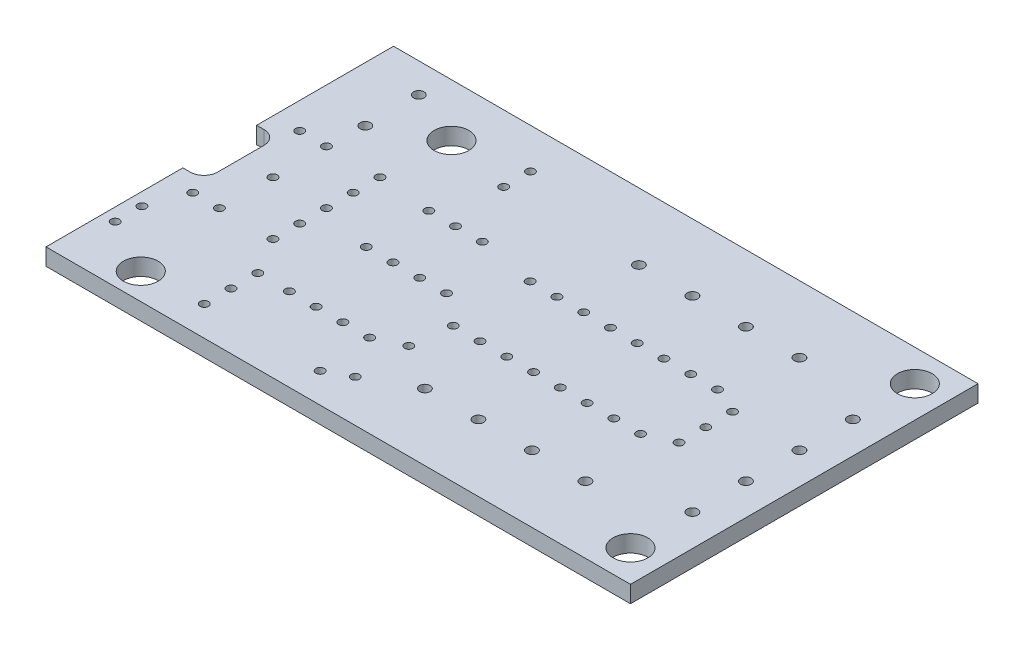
ISO-10303-21;
HEADER;
FILE_DESCRIPTION(('STEP AP214'),'2;1');
FILE_NAME('part.step','',(''),(''),'','','');
FILE_SCHEMA(('AUTOMOTIVE_DESIGN { 1 0 10303 214 1 1 1 1 }'));
ENDSEC;
DATA;
#1=APPLICATION_CONTEXT('core data for automotive mechanical design processes');
#2=APPLICATION_PROTOCOL_DEFINITION('international standard','automotive_design',2000,#1);
#3=PRODUCT_CONTEXT('',#1,'mechanical');
#4=PRODUCT('Part','Part','',(#3));
#5=PRODUCT_RELATED_PRODUCT_CATEGORY('part','',(#4));
#6=PRODUCT_DEFINITION_FORMATION('','',#4);
#7=PRODUCT_DEFINITION_CONTEXT('part definition',#1,'design');
#8=PRODUCT_DEFINITION('design','',#6,#7);
#9=PRODUCT_DEFINITION_SHAPE('','',#8);
#10=(LENGTH_UNIT() NAMED_UNIT(*) SI_UNIT(.MILLI.,.METRE.));
#11=(NAMED_UNIT(*) PLANE_ANGLE_UNIT() SI_UNIT($,.RADIAN.));
#12=(NAMED_UNIT(*) SI_UNIT($,.STERADIAN.) SOLID_ANGLE_UNIT());
#13=UNCERTAINTY_MEASURE_WITH_UNIT(LENGTH_MEASURE(1.E-05),#10,'distance_accuracy_value','');
#14=(GEOMETRIC_REPRESENTATION_CONTEXT(3) GLOBAL_UNCERTAINTY_ASSIGNED_CONTEXT((#13)) GLOBAL_UNIT_ASSIGNED_CONTEXT((#10,
#11,#12)) REPRESENTATION_CONTEXT('',''));
#15=CARTESIAN_POINT('',(0.,0.,0.));
#16=DIRECTION('',(0.,0.,1.));
#17=DIRECTION('',(1.,0.,0.));
#18=AXIS2_PLACEMENT_3D('',#15,#16,#17);
#19=CARTESIAN_POINT('',(0.700000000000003,1.6,-14.3));
#20=DIRECTION('',(0.,1.,0.));
#21=DIRECTION('',(0.,0.,1.));
#22=AXIS2_PLACEMENT_3D('',#19,#20,#21);
#23=PLANE('',#22);
#24=CARTESIAN_POINT('',(6.5,1.6,-2.5));
#25=DIRECTION('',(0.,1.,0.));
#26=DIRECTION('',(0.,0.,1.));
#27=AXIS2_PLACEMENT_3D('',#24,#25,#26);
#28=CIRCLE('',#27,1.65);
#29=CARTESIAN_POINT('',(6.5,1.6,-0.849999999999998));
#30=VERTEX_POINT('',#29);
#31=EDGE_CURVE('E527',#30,#30,#28,.T.);
#32=ORIENTED_EDGE('',*,*,#31,.F.);
#33=EDGE_LOOP('',(#32));
#34=FACE_BOUND('',#33,.T.);
#35=CARTESIAN_POINT('',(10.5,1.6,-28.));
#36=DIRECTION('',(0.,1.,0.));
#37=DIRECTION('',(0.,0.,1.));
#38=AXIS2_PLACEMENT_3D('',#35,#36,#37);
#39=CIRCLE('',#38,1.65);
#40=CARTESIAN_POINT('',(10.5,1.6,-26.35));
#41=VERTEX_POINT('',#40);
#42=EDGE_CURVE('E539',#41,#41,#39,.T.);
#43=ORIENTED_EDGE('',*,*,#42,.F.);
#44=EDGE_LOOP('',(#43));
#45=FACE_BOUND('',#44,.T.);
#46=CARTESIAN_POINT('',(2.50999999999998,1.6,-21.5799999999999));
#47=DIRECTION('',(0.,1.,0.));
#48=DIRECTION('',(0.,0.,1.));
#49=AXIS2_PLACEMENT_3D('',#46,#47,#48);
#50=CIRCLE('',#49,0.4);
#51=CARTESIAN_POINT('',(2.50999999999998,1.6,-21.1799999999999));
#52=VERTEX_POINT('',#51);
#53=EDGE_CURVE('E551',#52,#52,#50,.T.);
#54=ORIENTED_EDGE('',*,*,#53,.F.);
#55=EDGE_LOOP('',(#54));
#56=FACE_BOUND('',#55,.T.);
#57=CARTESIAN_POINT('',(5.04999999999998,1.6,-21.58));
#58=DIRECTION('',(0.,1.,0.));
#59=DIRECTION('',(0.,0.,1.));
#60=AXIS2_PLACEMENT_3D('',#57,#58,#59);
#61=CIRCLE('',#60,0.4);
#62=CARTESIAN_POINT('',(5.04999999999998,1.6,-21.18));
#63=VERTEX_POINT('',#62);
#64=EDGE_CURVE('E563',#63,#63,#61,.T.);
#65=ORIENTED_EDGE('',*,*,#64,.F.);
#66=EDGE_LOOP('',(#65));
#67=FACE_BOUND('',#66,.T.);
#68=CARTESIAN_POINT('',(5.05,1.6,-16.5));
#69=DIRECTION('',(0.,1.,0.));
#70=DIRECTION('',(0.,0.,1.));
#71=AXIS2_PLACEMENT_3D('',#68,#69,#70);
#72=CIRCLE('',#71,0.4);
#73=CARTESIAN_POINT('',(5.05,1.6,-16.1));
#74=VERTEX_POINT('',#73);
#75=EDGE_CURVE('E575',#74,#74,#72,.T.);
#76=ORIENTED_EDGE('',*,*,#75,.F.);
#77=EDGE_LOOP('',(#76));
#78=FACE_BOUND('',#77,.T.);
#79=CARTESIAN_POINT('',(10.13,1.6,-19.04));
#80=DIRECTION('',(0.,1.,0.));
#81=DIRECTION('',(0.,0.,1.));
#82=AXIS2_PLACEMENT_3D('',#79,#80,#81);
#83=CIRCLE('',#82,0.4);
#84=CARTESIAN_POINT('',(10.13,1.6,-18.64));
#85=VERTEX_POINT('',#84);
#86=EDGE_CURVE('E587',#85,#85,#83,.T.);
#87=ORIENTED_EDGE('',*,*,#86,.F.);
#88=EDGE_LOOP('',(#87));
#89=FACE_BOUND('',#88,.T.);
#90=CARTESIAN_POINT('',(10.13,1.6,-13.96));
#91=DIRECTION('',(0.,1.,0.));
#92=DIRECTION('',(0.,0.,1.));
#93=AXIS2_PLACEMENT_3D('',#90,#91,#92);
#94=CIRCLE('',#93,0.4);
#95=CARTESIAN_POINT('',(10.13,1.6,-13.56));
#96=VERTEX_POINT('',#95);
#97=EDGE_CURVE('E599',#96,#96,#94,.T.);
#98=ORIENTED_EDGE('',*,*,#97,.F.);
#99=EDGE_LOOP('',(#98));
#100=FACE_BOUND('',#99,.T.);
#101=CARTESIAN_POINT('',(1.21,1.6,-7.89999999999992));
#102=DIRECTION('',(0.,1.,0.));
#103=DIRECTION('',(0.,0.,1.));
#104=AXIS2_PLACEMENT_3D('',#101,#102,#103);
#105=CIRCLE('',#104,0.399999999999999);
#106=CARTESIAN_POINT('',(1.21,1.6,-7.49999999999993));
#107=VERTEX_POINT('',#106);
#108=EDGE_CURVE('E611',#107,#107,#105,.T.);
#109=ORIENTED_EDGE('',*,*,#108,.F.);
#110=EDGE_LOOP('',(#109));
#111=FACE_BOUND('',#110,.T.);
#112=CARTESIAN_POINT('',(16.8,1.6,-29.2000000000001));
#113=DIRECTION('',(0.,1.,0.));
#114=DIRECTION('',(0.,0.,1.));
#115=AXIS2_PLACEMENT_3D('',#112,#113,#114);
#116=CIRCLE('',#115,0.400000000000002);
#117=CARTESIAN_POINT('',(16.8,1.6,-28.8000000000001));
#118=VERTEX_POINT('',#117);
#119=EDGE_CURVE('E623',#118,#118,#116,.T.);
#120=ORIENTED_EDGE('',*,*,#119,.F.);
#121=EDGE_LOOP('',(#120));
#122=FACE_BOUND('',#121,.T.);
#123=CARTESIAN_POINT('',(25.37,1.6,-9.08));
#124=DIRECTION('',(0.,1.,0.));
#125=DIRECTION('',(0.,0.,1.));
#126=AXIS2_PLACEMENT_3D('',#123,#124,#125);
#127=CIRCLE('',#126,0.400000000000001);
#128=CARTESIAN_POINT('',(25.37,1.6,-8.68));
#129=VERTEX_POINT('',#128);
#130=EDGE_CURVE('E635',#129,#129,#127,.T.);
#131=ORIENTED_EDGE('',*,*,#130,.F.);
#132=EDGE_LOOP('',(#131));
#133=FACE_BOUND('',#132,.T.);
#134=CARTESIAN_POINT('',(12.21,1.6,-2.82));
#135=DIRECTION('',(0.,1.,0.));
#136=DIRECTION('',(0.,0.,1.));
#137=AXIS2_PLACEMENT_3D('',#134,#135,#136);
#138=CIRCLE('',#137,0.399999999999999);
#139=CARTESIAN_POINT('',(12.21,1.6,-2.42));
#140=VERTEX_POINT('',#139);
#141=EDGE_CURVE('E647',#140,#140,#138,.T.);
#142=ORIENTED_EDGE('',*,*,#141,.F.);
#143=EDGE_LOOP('',(#142));
#144=FACE_BOUND('',#143,.T.);
#145=CARTESIAN_POINT('',(15.21,1.6,-15.1999999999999));
#146=DIRECTION('',(0.,1.,0.));
#147=DIRECTION('',(0.,0.,1.));
#148=AXIS2_PLACEMENT_3D('',#145,#146,#147);
#149=CIRCLE('',#148,0.400000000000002);
#150=CARTESIAN_POINT('',(15.21,1.6,-14.7999999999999));
#151=VERTEX_POINT('',#150);
#152=EDGE_CURVE('E659',#151,#151,#149,.T.);
#153=ORIENTED_EDGE('',*,*,#152,.F.);
#154=EDGE_LOOP('',(#153));
#155=FACE_BOUND('',#154,.T.);
#156=CARTESIAN_POINT('',(17.75,1.6,-21.14));
#157=DIRECTION('',(0.,1.,0.));
#158=DIRECTION('',(0.,0.,1.));
#159=AXIS2_PLACEMENT_3D('',#156,#157,#158);
#160=CIRCLE('',#159,0.400000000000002);
#161=CARTESIAN_POINT('',(17.75,1.6,-20.74));
#162=VERTEX_POINT('',#161);
#163=EDGE_CURVE('E671',#162,#162,#160,.T.);
#164=ORIENTED_EDGE('',*,*,#163,.F.);
#165=EDGE_LOOP('',(#164));
#166=FACE_BOUND('',#165,.T.);
#167=CARTESIAN_POINT('',(17.75,1.6,-7.89999999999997));
#168=DIRECTION('',(0.,1.,0.));
#169=DIRECTION('',(0.,0.,1.));
#170=AXIS2_PLACEMENT_3D('',#167,#168,#169);
#171=CIRCLE('',#170,0.400000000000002);
#172=CARTESIAN_POINT('',(17.75,1.6,-7.49999999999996));
#173=VERTEX_POINT('',#172);
#174=EDGE_CURVE('E683',#173,#173,#171,.T.);
#175=ORIENTED_EDGE('',*,*,#174,.F.);
#176=EDGE_LOOP('',(#175));
#177=FACE_BOUND('',#176,.T.);
#178=CARTESIAN_POINT('',(20.29,1.6,-15.2));
#179=DIRECTION('',(0.,1.,0.));
#180=DIRECTION('',(0.,0.,1.));
#181=AXIS2_PLACEMENT_3D('',#178,#179,#180);
#182=CIRCLE('',#181,0.400000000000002);
#183=CARTESIAN_POINT('',(20.29,1.6,-14.8));
#184=VERTEX_POINT('',#183);
#185=EDGE_CURVE('E695',#184,#184,#182,.T.);
#186=ORIENTED_EDGE('',*,*,#185,.F.);
#187=EDGE_LOOP('',(#186));
#188=FACE_BOUND('',#187,.T.);
#189=CARTESIAN_POINT('',(12.21,1.6,-5.36));
#190=DIRECTION('',(0.,1.,0.));
#191=DIRECTION('',(0.,0.,1.));
#192=AXIS2_PLACEMENT_3D('',#189,#190,#191);
#193=CIRCLE('',#192,0.4);
#194=CARTESIAN_POINT('',(12.21,1.6,-4.96));
#195=VERTEX_POINT('',#194);
#196=EDGE_CURVE('E707',#195,#195,#193,.T.);
#197=ORIENTED_EDGE('',*,*,#196,.F.);
#198=EDGE_LOOP('',(#197));
#199=FACE_BOUND('',#198,.T.);
#200=CARTESIAN_POINT('',(22.83,1.6,-15.2));
#201=DIRECTION('',(0.,1.,0.));
#202=DIRECTION('',(0.,0.,1.));
#203=AXIS2_PLACEMENT_3D('',#200,#201,#202);
#204=CIRCLE('',#203,0.400000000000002);
#205=CARTESIAN_POINT('',(22.83,1.6,-14.8));
#206=VERTEX_POINT('',#205);
#207=EDGE_CURVE('E719',#206,#206,#204,.T.);
#208=ORIENTED_EDGE('',*,*,#207,.F.);
#209=EDGE_LOOP('',(#208));
#210=FACE_BOUND('',#209,.T.);
#211=CARTESIAN_POINT('',(44.88,1.6,-26.66));
#212=DIRECTION('',(0.,1.,0.));
#213=DIRECTION('',(0.,0.,-1.));
#214=AXIS2_PLACEMENT_3D('',#211,#212,#213);
#215=CIRCLE('',#214,0.499999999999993);
#216=CARTESIAN_POINT('',(44.88,1.6,-27.16));
#217=VERTEX_POINT('',#216);
#218=EDGE_CURVE('E731',#217,#217,#215,.T.);
#219=ORIENTED_EDGE('',*,*,#218,.F.);
#220=EDGE_LOOP('',(#219));
#221=FACE_BOUND('',#220,.T.);
#222=CARTESIAN_POINT('',(34.72,1.6,-26.6600000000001));
#223=DIRECTION('',(0.,1.,0.));
#224=DIRECTION('',(0.,0.,-1.));
#225=AXIS2_PLACEMENT_3D('',#222,#223,#224);
#226=CIRCLE('',#225,0.499999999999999);
#227=CARTESIAN_POINT('',(34.72,1.6,-27.1600000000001));
#228=VERTEX_POINT('',#227);
#229=EDGE_CURVE('E743',#228,#228,#226,.T.);
#230=ORIENTED_EDGE('',*,*,#229,.F.);
#231=EDGE_LOOP('',(#230));
#232=FACE_BOUND('',#231,.T.);
#233=CARTESIAN_POINT('',(34.72,1.6,-6.33999999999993));
#234=DIRECTION('',(0.,1.,0.));
#235=DIRECTION('',(0.,0.,1.));
#236=AXIS2_PLACEMENT_3D('',#233,#234,#235);
#237=CIRCLE('',#236,0.499999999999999);
#238=CARTESIAN_POINT('',(34.72,1.6,-5.83999999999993));
#239=VERTEX_POINT('',#238);
#240=EDGE_CURVE('E755',#239,#239,#237,.T.);
#241=ORIENTED_EDGE('',*,*,#240,.F.);
#242=EDGE_LOOP('',(#241));
#243=FACE_BOUND('',#242,.T.);
#244=CARTESIAN_POINT('',(29.64,1.6,-26.6600000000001));
#245=DIRECTION('',(0.,1.,0.));
#246=DIRECTION('',(0.,0.,-1.));
#247=AXIS2_PLACEMENT_3D('',#244,#245,#246);
#248=CIRCLE('',#247,0.499999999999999);
#249=CARTESIAN_POINT('',(29.64,1.6,-27.1600000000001));
#250=VERTEX_POINT('',#249);
#251=EDGE_CURVE('E767',#250,#250,#248,.T.);
#252=ORIENTED_EDGE('',*,*,#251,.F.);
#253=EDGE_LOOP('',(#252));
#254=FACE_BOUND('',#253,.T.);
#255=CARTESIAN_POINT('',(43.61,1.6,-20.15));
#256=DIRECTION('',(0.,1.,0.));
#257=DIRECTION('',(0.,0.,-1.));
#258=AXIS2_PLACEMENT_3D('',#255,#256,#257);
#259=CIRCLE('',#258,0.399999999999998);
#260=CARTESIAN_POINT('',(43.61,1.6,-20.55));
#261=VERTEX_POINT('',#260);
#262=EDGE_CURVE('E779',#261,#261,#259,.T.);
#263=ORIENTED_EDGE('',*,*,#262,.F.);
#264=EDGE_LOOP('',(#263));
#265=FACE_BOUND('',#264,.T.);
#266=CARTESIAN_POINT('',(38.528,1.6,-20.15));
#267=DIRECTION('',(0.,1.,0.));
#268=DIRECTION('',(0.,0.,-1.));
#269=AXIS2_PLACEMENT_3D('',#266,#267,#268);
#270=CIRCLE('',#269,0.400000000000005);
#271=CARTESIAN_POINT('',(38.528,1.6,-20.55));
#272=VERTEX_POINT('',#271);
#273=EDGE_CURVE('E791',#272,#272,#270,.T.);
#274=ORIENTED_EDGE('',*,*,#273,.F.);
#275=EDGE_LOOP('',(#274));
#276=FACE_BOUND('',#275,.T.);
#277=CARTESIAN_POINT('',(33.446,1.6,-20.1500000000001));
#278=DIRECTION('',(0.,1.,0.));
#279=DIRECTION('',(0.,0.,-1.));
#280=AXIS2_PLACEMENT_3D('',#277,#278,#279);
#281=CIRCLE('',#280,0.399999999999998);
#282=CARTESIAN_POINT('',(33.446,1.6,-20.5500000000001));
#283=VERTEX_POINT('',#282);
#284=EDGE_CURVE('E803',#283,#283,#281,.T.);
#285=ORIENTED_EDGE('',*,*,#284,.F.);
#286=EDGE_LOOP('',(#285));
#287=FACE_BOUND('',#286,.T.);
#288=CARTESIAN_POINT('',(28.364,1.6,-20.1500000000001));
#289=DIRECTION('',(0.,1.,0.));
#290=DIRECTION('',(0.,0.,-1.));
#291=AXIS2_PLACEMENT_3D('',#288,#289,#290);
#292=CIRCLE('',#291,0.399999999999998);
#293=CARTESIAN_POINT('',(28.364,1.6,-20.5500000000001));
#294=VERTEX_POINT('',#293);
#295=EDGE_CURVE('E815',#294,#294,#292,.T.);
#296=ORIENTED_EDGE('',*,*,#295,.F.);
#297=EDGE_LOOP('',(#296));
#298=FACE_BOUND('',#297,.T.);
#299=CARTESIAN_POINT('',(28.364,1.6,-12.8499999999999));
#300=DIRECTION('',(0.,1.,0.));
#301=DIRECTION('',(0.,0.,1.));
#302=AXIS2_PLACEMENT_3D('',#299,#300,#301);
#303=CIRCLE('',#302,0.399999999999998);
#304=CARTESIAN_POINT('',(28.364,1.6,-12.4499999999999));
#305=VERTEX_POINT('',#304);
#306=EDGE_CURVE('E827',#305,#305,#303,.T.);
#307=ORIENTED_EDGE('',*,*,#306,.F.);
#308=EDGE_LOOP('',(#307));
#309=FACE_BOUND('',#308,.T.);
#310=CARTESIAN_POINT('',(33.446,1.6,-12.8499999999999));
#311=DIRECTION('',(0.,1.,0.));
#312=DIRECTION('',(0.,0.,1.));
#313=AXIS2_PLACEMENT_3D('',#310,#311,#312);
#314=CIRCLE('',#313,0.399999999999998);
#315=CARTESIAN_POINT('',(33.446,1.6,-12.4499999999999));
#316=VERTEX_POINT('',#315);
#317=EDGE_CURVE('E839',#316,#316,#314,.T.);
#318=ORIENTED_EDGE('',*,*,#317,.F.);
#319=EDGE_LOOP('',(#318));
#320=FACE_BOUND('',#319,.T.);
#321=CARTESIAN_POINT('',(38.528,1.6,-12.85));
#322=DIRECTION('',(0.,1.,0.));
#323=DIRECTION('',(0.,0.,1.));
#324=AXIS2_PLACEMENT_3D('',#321,#322,#323);
#325=CIRCLE('',#324,0.400000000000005);
#326=CARTESIAN_POINT('',(38.528,1.6,-12.45));
#327=VERTEX_POINT('',#326);
#328=EDGE_CURVE('E851',#327,#327,#325,.T.);
#329=ORIENTED_EDGE('',*,*,#328,.F.);
#330=EDGE_LOOP('',(#329));
#331=FACE_BOUND('',#330,.T.);
#332=CARTESIAN_POINT('',(25.823,1.6,-20.1500000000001));
#333=DIRECTION('',(0.,1.,0.));
#334=DIRECTION('',(0.,0.,-1.));
#335=AXIS2_PLACEMENT_3D('',#332,#333,#334);
#336=CIRCLE('',#335,0.399999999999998);
#337=CARTESIAN_POINT('',(25.823,1.6,-20.5500000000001));
#338=VERTEX_POINT('',#337);
#339=EDGE_CURVE('E863',#338,#338,#336,.T.);
#340=ORIENTED_EDGE('',*,*,#339,.F.);
#341=EDGE_LOOP('',(#340));
#342=FACE_BOUND('',#341,.T.);
#343=CARTESIAN_POINT('',(46.15,1.6,-19.04));
#344=DIRECTION('',(0.,1.,0.));
#345=DIRECTION('',(0.,0.,-1.));
#346=AXIS2_PLACEMENT_3D('',#343,#344,#345);
#347=CIRCLE('',#346,0.399999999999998);
#348=CARTESIAN_POINT('',(46.15,1.6,-19.44));
#349=VERTEX_POINT('',#348);
#350=EDGE_CURVE('E875',#349,#349,#347,.T.);
#351=ORIENTED_EDGE('',*,*,#350,.F.);
#352=EDGE_LOOP('',(#351));
#353=FACE_BOUND('',#352,.T.);
#354=CARTESIAN_POINT('',(46.15,1.6,-13.96));
#355=DIRECTION('',(0.,1.,0.));
#356=DIRECTION('',(0.,0.,1.));
#357=AXIS2_PLACEMENT_3D('',#354,#355,#356);
#358=CIRCLE('',#357,0.399999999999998);
#359=CARTESIAN_POINT('',(46.15,1.6,-13.56));
#360=VERTEX_POINT('',#359);
#361=EDGE_CURVE('E887',#360,#360,#358,.T.);
#362=ORIENTED_EDGE('',*,*,#361,.F.);
#363=EDGE_LOOP('',(#362));
#364=FACE_BOUND('',#363,.T.);
#365=CARTESIAN_POINT('',(52.5,1.6,-24.12));
#366=DIRECTION('',(0.,1.,0.));
#367=DIRECTION('',(0.,0.,-1.));
#368=AXIS2_PLACEMENT_3D('',#365,#366,#367);
#369=CIRCLE('',#368,0.499999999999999);
#370=CARTESIAN_POINT('',(52.5,1.6,-24.62));
#371=VERTEX_POINT('',#370);
#372=EDGE_CURVE('E899',#371,#371,#369,.T.);
#373=ORIENTED_EDGE('',*,*,#372,.F.);
#374=EDGE_LOOP('',(#373));
#375=FACE_BOUND('',#374,.T.);
#376=CARTESIAN_POINT('',(52.5,1.6,-13.96));
#377=DIRECTION('',(0.,1.,0.));
#378=DIRECTION('',(0.,0.,1.));
#379=AXIS2_PLACEMENT_3D('',#376,#377,#378);
#380=CIRCLE('',#379,0.499999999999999);
#381=CARTESIAN_POINT('',(52.5,1.6,-13.46));
#382=VERTEX_POINT('',#381);
#383=EDGE_CURVE('E911',#382,#382,#380,.T.);
#384=ORIENTED_EDGE('',*,*,#383,.F.);
#385=EDGE_LOOP('',(#384));
#386=FACE_BOUND('',#385,.T.);
#387=CARTESIAN_POINT('',(52.5,1.6,-3.));
#388=DIRECTION('',(0.,1.,0.));
#389=DIRECTION('',(0.,0.,1.));
#390=AXIS2_PLACEMENT_3D('',#387,#388,#389);
#391=CIRCLE('',#390,1.65);
#392=CARTESIAN_POINT('',(52.5,1.6,-1.35));
#393=VERTEX_POINT('',#392);
#394=EDGE_CURVE('E129',#393,#393,#391,.T.);
#395=ORIENTED_EDGE('',*,*,#394,.F.);
#396=EDGE_LOOP('',(#395));
#397=FACE_BOUND('',#396,.T.);
#398=DIRECTION('',(0.,0.,1.));
#399=VECTOR('',#398,1.);
#400=CARTESIAN_POINT('',(0.,1.6,0.));
#401=LINE('',#400,#399);
#402=CARTESIAN_POINT('',(0.,1.6,-13.));
#403=VERTEX_POINT('',#402);
#404=CARTESIAN_POINT('',(0.,1.6,0.));
#405=VERTEX_POINT('',#404);
#406=EDGE_CURVE('E151',#403,#405,#401,.T.);
#407=ORIENTED_EDGE('',*,*,#406,.T.);
#408=DIRECTION('',(1.,0.,0.));
#409=VECTOR('',#408,1.);
#410=CARTESIAN_POINT('',(0.,1.6,0.));
#411=LINE('',#410,#409);
#412=CARTESIAN_POINT('',(55.5000000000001,1.6,-1.32168529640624E-13));
#413=VERTEX_POINT('',#412);
#414=EDGE_CURVE('E124',#405,#413,#411,.T.);
#415=ORIENTED_EDGE('',*,*,#414,.T.);
#416=DIRECTION('',(0.,0.,-1.));
#417=VECTOR('',#416,1.);
#418=CARTESIAN_POINT('',(55.5000000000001,1.6,-1.32168529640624E-13));
#419=LINE('',#418,#417);
#420=CARTESIAN_POINT('',(55.5,1.6,-33.0000000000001));
#421=VERTEX_POINT('',#420);
#422=EDGE_CURVE('E154',#413,#421,#419,.T.);
#423=ORIENTED_EDGE('',*,*,#422,.T.);
#424=DIRECTION('',(-1.,0.,0.));
#425=VECTOR('',#424,1.);
#426=CARTESIAN_POINT('',(0.,1.6,-33.));
#427=LINE('',#426,#425);
#428=CARTESIAN_POINT('',(0.,1.6,-33.));
#429=VERTEX_POINT('',#428);
#430=EDGE_CURVE('E156',#421,#429,#427,.T.);
#431=ORIENTED_EDGE('',*,*,#430,.T.);
#432=DIRECTION('',(0.,0.,1.));
#433=VECTOR('',#432,1.);
#434=CARTESIAN_POINT('',(0.,1.6,-20.));
#435=LINE('',#434,#433);
#436=CARTESIAN_POINT('',(0.,1.6,-20.));
#437=VERTEX_POINT('',#436);
#438=EDGE_CURVE('E158',#429,#437,#435,.T.);
#439=ORIENTED_EDGE('',*,*,#438,.T.);
#440=DIRECTION('',(1.,0.,0.));
#441=VECTOR('',#440,1.);
#442=CARTESIAN_POINT('',(0.,1.6,-20.));
#443=LINE('',#442,#441);
#444=CARTESIAN_POINT('',(0.700000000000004,1.6,-20.));
#445=VERTEX_POINT('',#444);
#446=EDGE_CURVE('E160',#437,#445,#443,.T.);
#447=ORIENTED_EDGE('',*,*,#446,.T.);
#448=CARTESIAN_POINT('',(0.700000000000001,1.6,-18.7));
#449=DIRECTION('',(0.,-1.,0.));
#450=DIRECTION('',(0.,0.,-1.));
#451=AXIS2_PLACEMENT_3D('',#448,#449,#450);
#452=CIRCLE('',#451,1.3);
#453=CARTESIAN_POINT('',(2.,1.6,-18.7));
#454=VERTEX_POINT('',#453);
#455=EDGE_CURVE('E162',#445,#454,#452,.T.);
#456=ORIENTED_EDGE('',*,*,#455,.T.);
#457=DIRECTION('',(0.,0.,1.));
#458=VECTOR('',#457,1.);
#459=CARTESIAN_POINT('',(2.00000000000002,1.6,-14.3));
#460=LINE('',#459,#458);
#461=CARTESIAN_POINT('',(2.00000000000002,1.6,-14.3));
#462=VERTEX_POINT('',#461);
#463=EDGE_CURVE('E164',#454,#462,#460,.T.);
#464=ORIENTED_EDGE('',*,*,#463,.T.);
#465=CARTESIAN_POINT('',(0.700000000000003,1.6,-14.3));
#466=DIRECTION('',(0.,-1.,0.));
#467=DIRECTION('',(0.,0.,1.));
#468=AXIS2_PLACEMENT_3D('',#465,#466,#467);
#469=CIRCLE('',#468,1.30000000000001);
#470=CARTESIAN_POINT('',(0.700000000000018,1.6,-13.));
#471=VERTEX_POINT('',#470);
#472=EDGE_CURVE('E53',#462,#471,#469,.T.);
#473=ORIENTED_EDGE('',*,*,#472,.T.);
#474=DIRECTION('',(-1.,0.,0.));
#475=VECTOR('',#474,1.);
#476=CARTESIAN_POINT('',(0.,1.6,-13.));
#477=LINE('',#476,#475);
#478=EDGE_CURVE('E48',#471,#403,#477,.T.);
#479=ORIENTED_EDGE('',*,*,#478,.T.);
#480=EDGE_LOOP('',(#407,#415,#423,#431,#439,#447,#456,#464,#473,#479));
#481=FACE_BOUND('',#480,.T.);
#482=CARTESIAN_POINT('',(52.5,1.6,-8.88));
#483=DIRECTION('',(0.,1.,0.));
#484=DIRECTION('',(0.,0.,1.));
#485=AXIS2_PLACEMENT_3D('',#482,#483,#484);
#486=CIRCLE('',#485,0.499999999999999);
#487=CARTESIAN_POINT('',(52.5,1.6,-8.38));
#488=VERTEX_POINT('',#487);
#489=EDGE_CURVE('E917',#488,#488,#486,.T.);
#490=ORIENTED_EDGE('',*,*,#489,.F.);
#491=EDGE_LOOP('',(#490));
#492=FACE_BOUND('',#491,.T.);
#493=CARTESIAN_POINT('',(52.5,1.6,-30.));
#494=DIRECTION('',(0.,1.,0.));
#495=DIRECTION('',(0.,0.,-1.));
#496=AXIS2_PLACEMENT_3D('',#493,#494,#495);
#497=CIRCLE('',#496,1.65);
#498=CARTESIAN_POINT('',(52.5,1.6,-31.65));
#499=VERTEX_POINT('',#498);
#500=EDGE_CURVE('E905',#499,#499,#497,.T.);
#501=ORIENTED_EDGE('',*,*,#500,.F.);
#502=EDGE_LOOP('',(#501));
#503=FACE_BOUND('',#502,.T.);
#504=CARTESIAN_POINT('',(52.5,1.6,-19.04));
#505=DIRECTION('',(0.,1.,0.));
#506=DIRECTION('',(0.,0.,-1.));
#507=AXIS2_PLACEMENT_3D('',#504,#505,#506);
#508=CIRCLE('',#507,0.499999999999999);
#509=CARTESIAN_POINT('',(52.5,1.6,-19.54));
#510=VERTEX_POINT('',#509);
#511=EDGE_CURVE('E893',#510,#510,#508,.T.);
#512=ORIENTED_EDGE('',*,*,#511,.F.);
#513=EDGE_LOOP('',(#512));
#514=FACE_BOUND('',#513,.T.);
#515=CARTESIAN_POINT('',(46.15,1.6,-16.5));
#516=DIRECTION('',(0.,1.,0.));
#517=DIRECTION('',(0.,0.,1.));
#518=AXIS2_PLACEMENT_3D('',#515,#516,#517);
#519=CIRCLE('',#518,0.399999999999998);
#520=CARTESIAN_POINT('',(46.15,1.6,-16.1));
#521=VERTEX_POINT('',#520);
#522=EDGE_CURVE('E881',#521,#521,#519,.T.);
#523=ORIENTED_EDGE('',*,*,#522,.F.);
#524=EDGE_LOOP('',(#523));
#525=FACE_BOUND('',#524,.T.);
#526=CARTESIAN_POINT('',(43.61,1.6,-12.85));
#527=DIRECTION('',(0.,1.,0.));
#528=DIRECTION('',(0.,0.,1.));
#529=AXIS2_PLACEMENT_3D('',#526,#527,#528);
#530=CIRCLE('',#529,0.399999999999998);
#531=CARTESIAN_POINT('',(43.61,1.6,-12.45));
#532=VERTEX_POINT('',#531);
#533=EDGE_CURVE('E869',#532,#532,#530,.T.);
#534=ORIENTED_EDGE('',*,*,#533,.F.);
#535=EDGE_LOOP('',(#534));
#536=FACE_BOUND('',#535,.T.);
#537=CARTESIAN_POINT('',(41.069,1.6,-12.85));
#538=DIRECTION('',(0.,1.,0.));
#539=DIRECTION('',(0.,0.,1.));
#540=AXIS2_PLACEMENT_3D('',#537,#538,#539);
#541=CIRCLE('',#540,0.399999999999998);
#542=CARTESIAN_POINT('',(41.069,1.6,-12.45));
#543=VERTEX_POINT('',#542);
#544=EDGE_CURVE('E857',#543,#543,#541,.T.);
#545=ORIENTED_EDGE('',*,*,#544,.F.);
#546=EDGE_LOOP('',(#545));
#547=FACE_BOUND('',#546,.T.);
#548=CARTESIAN_POINT('',(35.987,1.6,-12.8499999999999));
#549=DIRECTION('',(0.,1.,0.));
#550=DIRECTION('',(0.,0.,1.));
#551=AXIS2_PLACEMENT_3D('',#548,#549,#550);
#552=CIRCLE('',#551,0.399999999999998);
#553=CARTESIAN_POINT('',(35.987,1.6,-12.4499999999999));
#554=VERTEX_POINT('',#553);
#555=EDGE_CURVE('E845',#554,#554,#552,.T.);
#556=ORIENTED_EDGE('',*,*,#555,.F.);
#557=EDGE_LOOP('',(#556));
#558=FACE_BOUND('',#557,.T.);
#559=CARTESIAN_POINT('',(30.905,1.6,-12.8499999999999));
#560=DIRECTION('',(0.,1.,0.));
#561=DIRECTION('',(0.,0.,1.));
#562=AXIS2_PLACEMENT_3D('',#559,#560,#561);
#563=CIRCLE('',#562,0.400000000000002);
#564=CARTESIAN_POINT('',(30.905,1.6,-12.4499999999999));
#565=VERTEX_POINT('',#564);
#566=EDGE_CURVE('E833',#565,#565,#563,.T.);
#567=ORIENTED_EDGE('',*,*,#566,.F.);
#568=EDGE_LOOP('',(#567));
#569=FACE_BOUND('',#568,.T.);
#570=CARTESIAN_POINT('',(25.823,1.6,-12.8499999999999));
#571=DIRECTION('',(0.,1.,0.));
#572=DIRECTION('',(0.,0.,1.));
#573=AXIS2_PLACEMENT_3D('',#570,#571,#572);
#574=CIRCLE('',#573,0.399999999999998);
#575=CARTESIAN_POINT('',(25.823,1.6,-12.4499999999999));
#576=VERTEX_POINT('',#575);
#577=EDGE_CURVE('E821',#576,#576,#574,.T.);
#578=ORIENTED_EDGE('',*,*,#577,.F.);
#579=EDGE_LOOP('',(#578));
#580=FACE_BOUND('',#579,.T.);
#581=CARTESIAN_POINT('',(30.905,1.6,-20.1500000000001));
#582=DIRECTION('',(0.,1.,0.));
#583=DIRECTION('',(0.,0.,-1.));
#584=AXIS2_PLACEMENT_3D('',#581,#582,#583);
#585=CIRCLE('',#584,0.399999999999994);
#586=CARTESIAN_POINT('',(30.905,1.6,-20.5500000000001));
#587=VERTEX_POINT('',#586);
#588=EDGE_CURVE('E809',#587,#587,#585,.T.);
#589=ORIENTED_EDGE('',*,*,#588,.F.);
#590=EDGE_LOOP('',(#589));
#591=FACE_BOUND('',#590,.T.);
#592=CARTESIAN_POINT('',(35.987,1.6,-20.1500000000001));
#593=DIRECTION('',(0.,1.,0.));
#594=DIRECTION('',(0.,0.,-1.));
#595=AXIS2_PLACEMENT_3D('',#592,#593,#594);
#596=CIRCLE('',#595,0.399999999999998);
#597=CARTESIAN_POINT('',(35.987,1.6,-20.5500000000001));
#598=VERTEX_POINT('',#597);
#599=EDGE_CURVE('E797',#598,#598,#596,.T.);
#600=ORIENTED_EDGE('',*,*,#599,.F.);
#601=EDGE_LOOP('',(#600));
#602=FACE_BOUND('',#601,.T.);
#603=CARTESIAN_POINT('',(41.069,1.6,-20.15));
#604=DIRECTION('',(0.,1.,0.));
#605=DIRECTION('',(0.,0.,-1.));
#606=AXIS2_PLACEMENT_3D('',#603,#604,#605);
#607=CIRCLE('',#606,0.399999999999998);
#608=CARTESIAN_POINT('',(41.069,1.6,-20.55));
#609=VERTEX_POINT('',#608);
#610=EDGE_CURVE('E785',#609,#609,#607,.T.);
#611=ORIENTED_EDGE('',*,*,#610,.F.);
#612=EDGE_LOOP('',(#611));
#613=FACE_BOUND('',#612,.T.);
#614=CARTESIAN_POINT('',(44.88,1.6,-6.34));
#615=DIRECTION('',(0.,1.,0.));
#616=DIRECTION('',(0.,0.,1.));
#617=AXIS2_PLACEMENT_3D('',#614,#615,#616);
#618=CIRCLE('',#617,0.499999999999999);
#619=CARTESIAN_POINT('',(44.88,1.6,-5.84));
#620=VERTEX_POINT('',#619);
#621=EDGE_CURVE('E773',#620,#620,#618,.T.);
#622=ORIENTED_EDGE('',*,*,#621,.F.);
#623=EDGE_LOOP('',(#622));
#624=FACE_BOUND('',#623,.T.);
#625=CARTESIAN_POINT('',(39.8,1.6,-6.33999999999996));
#626=DIRECTION('',(0.,1.,0.));
#627=DIRECTION('',(0.,0.,1.));
#628=AXIS2_PLACEMENT_3D('',#625,#626,#627);
#629=CIRCLE('',#628,0.499999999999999);
#630=CARTESIAN_POINT('',(39.8,1.6,-5.83999999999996));
#631=VERTEX_POINT('',#630);
#632=EDGE_CURVE('E761',#631,#631,#629,.T.);
#633=ORIENTED_EDGE('',*,*,#632,.F.);
#634=EDGE_LOOP('',(#633));
#635=FACE_BOUND('',#634,.T.);
#636=CARTESIAN_POINT('',(29.64,1.6,-6.33999999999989));
#637=DIRECTION('',(0.,1.,0.));
#638=DIRECTION('',(0.,0.,1.));
#639=AXIS2_PLACEMENT_3D('',#636,#637,#638);
#640=CIRCLE('',#639,0.499999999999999);
#641=CARTESIAN_POINT('',(29.64,1.6,-5.83999999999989));
#642=VERTEX_POINT('',#641);
#643=EDGE_CURVE('E749',#642,#642,#640,.T.);
#644=ORIENTED_EDGE('',*,*,#643,.F.);
#645=EDGE_LOOP('',(#644));
#646=FACE_BOUND('',#645,.T.);
#647=CARTESIAN_POINT('',(39.8,1.6,-26.66));
#648=DIRECTION('',(0.,1.,0.));
#649=DIRECTION('',(0.,0.,-1.));
#650=AXIS2_PLACEMENT_3D('',#647,#648,#649);
#651=CIRCLE('',#650,0.499999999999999);
#652=CARTESIAN_POINT('',(39.8,1.6,-27.16));
#653=VERTEX_POINT('',#652);
#654=EDGE_CURVE('E737',#653,#653,#651,.T.);
#655=ORIENTED_EDGE('',*,*,#654,.F.);
#656=EDGE_LOOP('',(#655));
#657=FACE_BOUND('',#656,.T.);
#658=CARTESIAN_POINT('',(22.83,1.6,-7.9));
#659=DIRECTION('',(0.,1.,0.));
#660=DIRECTION('',(0.,0.,1.));
#661=AXIS2_PLACEMENT_3D('',#658,#659,#660);
#662=CIRCLE('',#661,0.400000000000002);
#663=CARTESIAN_POINT('',(22.83,1.6,-7.5));
#664=VERTEX_POINT('',#663);
#665=EDGE_CURVE('E725',#664,#664,#662,.T.);
#666=ORIENTED_EDGE('',*,*,#665,.F.);
#667=EDGE_LOOP('',(#666));
#668=FACE_BOUND('',#667,.T.);
#669=CARTESIAN_POINT('',(12.21,1.6,-7.9));
#670=DIRECTION('',(0.,1.,0.));
#671=DIRECTION('',(0.,0.,1.));
#672=AXIS2_PLACEMENT_3D('',#669,#670,#671);
#673=CIRCLE('',#672,0.399999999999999);
#674=CARTESIAN_POINT('',(12.21,1.6,-7.5));
#675=VERTEX_POINT('',#674);
#676=EDGE_CURVE('E713',#675,#675,#673,.T.);
#677=ORIENTED_EDGE('',*,*,#676,.F.);
#678=EDGE_LOOP('',(#677));
#679=FACE_BOUND('',#678,.T.);
#680=CARTESIAN_POINT('',(20.29,1.6,-7.89999999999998));
#681=DIRECTION('',(0.,1.,0.));
#682=DIRECTION('',(0.,0.,1.));
#683=AXIS2_PLACEMENT_3D('',#680,#681,#682);
#684=CIRCLE('',#683,0.400000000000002);
#685=CARTESIAN_POINT('',(20.29,1.6,-7.49999999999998));
#686=VERTEX_POINT('',#685);
#687=EDGE_CURVE('E701',#686,#686,#684,.T.);
#688=ORIENTED_EDGE('',*,*,#687,.F.);
#689=EDGE_LOOP('',(#688));
#690=FACE_BOUND('',#689,.T.);
#691=CARTESIAN_POINT('',(20.29,1.6,-21.14));
#692=DIRECTION('',(0.,1.,0.));
#693=DIRECTION('',(0.,0.,1.));
#694=AXIS2_PLACEMENT_3D('',#691,#692,#693);
#695=CIRCLE('',#694,0.400000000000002);
#696=CARTESIAN_POINT('',(20.29,1.6,-20.74));
#697=VERTEX_POINT('',#696);
#698=EDGE_CURVE('E689',#697,#697,#695,.T.);
#699=ORIENTED_EDGE('',*,*,#698,.F.);
#700=EDGE_LOOP('',(#699));
#701=FACE_BOUND('',#700,.T.);
#702=CARTESIAN_POINT('',(17.75,1.6,-15.2));
#703=DIRECTION('',(0.,1.,0.));
#704=DIRECTION('',(0.,0.,1.));
#705=AXIS2_PLACEMENT_3D('',#702,#703,#704);
#706=CIRCLE('',#705,0.400000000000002);
#707=CARTESIAN_POINT('',(17.75,1.6,-14.8));
#708=VERTEX_POINT('',#707);
#709=EDGE_CURVE('E677',#708,#708,#706,.T.);
#710=ORIENTED_EDGE('',*,*,#709,.F.);
#711=EDGE_LOOP('',(#710));
#712=FACE_BOUND('',#711,.T.);
#713=CARTESIAN_POINT('',(15.21,1.6,-7.89999999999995));
#714=DIRECTION('',(0.,1.,0.));
#715=DIRECTION('',(0.,0.,1.));
#716=AXIS2_PLACEMENT_3D('',#713,#714,#715);
#717=CIRCLE('',#716,0.400000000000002);
#718=CARTESIAN_POINT('',(15.21,1.6,-7.49999999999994));
#719=VERTEX_POINT('',#718);
#720=EDGE_CURVE('E665',#719,#719,#717,.T.);
#721=ORIENTED_EDGE('',*,*,#720,.F.);
#722=EDGE_LOOP('',(#721));
#723=FACE_BOUND('',#722,.T.);
#724=CARTESIAN_POINT('',(15.21,1.6,-21.1399999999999));
#725=DIRECTION('',(0.,1.,0.));
#726=DIRECTION('',(0.,0.,1.));
#727=AXIS2_PLACEMENT_3D('',#724,#725,#726);
#728=CIRCLE('',#727,0.400000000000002);
#729=CARTESIAN_POINT('',(15.21,1.6,-20.7399999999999));
#730=VERTEX_POINT('',#729);
#731=EDGE_CURVE('E653',#730,#730,#728,.T.);
#732=ORIENTED_EDGE('',*,*,#731,.F.);
#733=EDGE_LOOP('',(#732));
#734=FACE_BOUND('',#733,.T.);
#735=CARTESIAN_POINT('',(25.37,1.6,-4.));
#736=DIRECTION('',(0.,1.,0.));
#737=DIRECTION('',(0.,0.,1.));
#738=AXIS2_PLACEMENT_3D('',#735,#736,#737);
#739=CIRCLE('',#738,0.400000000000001);
#740=CARTESIAN_POINT('',(25.37,1.6,-3.6));
#741=VERTEX_POINT('',#740);
#742=EDGE_CURVE('E641',#741,#741,#739,.T.);
#743=ORIENTED_EDGE('',*,*,#742,.F.);
#744=EDGE_LOOP('',(#743));
#745=FACE_BOUND('',#744,.T.);
#746=CARTESIAN_POINT('',(16.8,1.6,-26.6600000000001));
#747=DIRECTION('',(0.,1.,0.));
#748=DIRECTION('',(0.,0.,1.));
#749=AXIS2_PLACEMENT_3D('',#746,#747,#748);
#750=CIRCLE('',#749,0.400000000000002);
#751=CARTESIAN_POINT('',(16.8,1.6,-26.2600000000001));
#752=VERTEX_POINT('',#751);
#753=EDGE_CURVE('E629',#752,#752,#750,.T.);
#754=ORIENTED_EDGE('',*,*,#753,.F.);
#755=EDGE_LOOP('',(#754));
#756=FACE_BOUND('',#755,.T.);
#757=CARTESIAN_POINT('',(23.2100000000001,1.6,-2.82));
#758=DIRECTION('',(0.,1.,0.));
#759=DIRECTION('',(0.,0.,1.));
#760=AXIS2_PLACEMENT_3D('',#757,#758,#759);
#761=CIRCLE('',#760,0.399999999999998);
#762=CARTESIAN_POINT('',(23.2100000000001,1.6,-2.42));
#763=VERTEX_POINT('',#762);
#764=EDGE_CURVE('E617',#763,#763,#761,.T.);
#765=ORIENTED_EDGE('',*,*,#764,.F.);
#766=EDGE_LOOP('',(#765));
#767=FACE_BOUND('',#766,.T.);
#768=CARTESIAN_POINT('',(10.13,1.6,-16.5));
#769=DIRECTION('',(0.,1.,0.));
#770=DIRECTION('',(0.,0.,1.));
#771=AXIS2_PLACEMENT_3D('',#768,#769,#770);
#772=CIRCLE('',#771,0.4);
#773=CARTESIAN_POINT('',(10.13,1.6,-16.1));
#774=VERTEX_POINT('',#773);
#775=EDGE_CURVE('E605',#774,#774,#772,.T.);
#776=ORIENTED_EDGE('',*,*,#775,.F.);
#777=EDGE_LOOP('',(#776));
#778=FACE_BOUND('',#777,.T.);
#779=CARTESIAN_POINT('',(10.1300000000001,1.6,-11.42));
#780=DIRECTION('',(0.,1.,0.));
#781=DIRECTION('',(0.,0.,1.));
#782=AXIS2_PLACEMENT_3D('',#779,#780,#781);
#783=CIRCLE('',#782,0.4);
#784=CARTESIAN_POINT('',(10.1300000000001,1.6,-11.02));
#785=VERTEX_POINT('',#784);
#786=EDGE_CURVE('E593',#785,#785,#783,.T.);
#787=ORIENTED_EDGE('',*,*,#786,.F.);
#788=EDGE_LOOP('',(#787));
#789=FACE_BOUND('',#788,.T.);
#790=CARTESIAN_POINT('',(10.13,1.6,-21.58));
#791=DIRECTION('',(0.,1.,0.));
#792=DIRECTION('',(0.,0.,1.));
#793=AXIS2_PLACEMENT_3D('',#790,#791,#792);
#794=CIRCLE('',#793,0.4);
#795=CARTESIAN_POINT('',(10.13,1.6,-21.18));
#796=VERTEX_POINT('',#795);
#797=EDGE_CURVE('E581',#796,#796,#794,.T.);
#798=ORIENTED_EDGE('',*,*,#797,.F.);
#799=EDGE_LOOP('',(#798));
#800=FACE_BOUND('',#799,.T.);
#801=CARTESIAN_POINT('',(5.05000000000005,1.6,-11.42));
#802=DIRECTION('',(0.,1.,0.));
#803=DIRECTION('',(0.,0.,1.));
#804=AXIS2_PLACEMENT_3D('',#801,#802,#803);
#805=CIRCLE('',#804,0.4);
#806=CARTESIAN_POINT('',(5.05000000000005,1.6,-11.02));
#807=VERTEX_POINT('',#806);
#808=EDGE_CURVE('E569',#807,#807,#805,.T.);
#809=ORIENTED_EDGE('',*,*,#808,.F.);
#810=EDGE_LOOP('',(#809));
#811=FACE_BOUND('',#810,.T.);
#812=CARTESIAN_POINT('',(2.51000000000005,1.6,-11.4199999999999));
#813=DIRECTION('',(0.,1.,0.));
#814=DIRECTION('',(0.,0.,1.));
#815=AXIS2_PLACEMENT_3D('',#812,#813,#814);
#816=CIRCLE('',#815,0.4);
#817=CARTESIAN_POINT('',(2.51000000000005,1.6,-11.0199999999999));
#818=VERTEX_POINT('',#817);
#819=EDGE_CURVE('E557',#818,#818,#816,.T.);
#820=ORIENTED_EDGE('',*,*,#819,.F.);
#821=EDGE_LOOP('',(#820));
#822=FACE_BOUND('',#821,.T.);
#823=CARTESIAN_POINT('',(5.2,1.6,-30.2));
#824=DIRECTION('',(0.,1.,0.));
#825=DIRECTION('',(0.,0.,1.));
#826=AXIS2_PLACEMENT_3D('',#823,#824,#825);
#827=CIRCLE('',#826,0.500000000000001);
#828=CARTESIAN_POINT('',(5.2,1.6,-29.7));
#829=VERTEX_POINT('',#828);
#830=EDGE_CURVE('E545',#829,#829,#827,.T.);
#831=ORIENTED_EDGE('',*,*,#830,.F.);
#832=EDGE_LOOP('',(#831));
#833=FACE_BOUND('',#832,.T.);
#834=CARTESIAN_POINT('',(5.20000000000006,1.6,-25.12));
#835=DIRECTION('',(0.,1.,0.));
#836=DIRECTION('',(0.,0.,1.));
#837=AXIS2_PLACEMENT_3D('',#834,#835,#836);
#838=CIRCLE('',#837,0.500000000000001);
#839=CARTESIAN_POINT('',(5.20000000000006,1.6,-24.62));
#840=VERTEX_POINT('',#839);
#841=EDGE_CURVE('E533',#840,#840,#838,.T.);
#842=ORIENTED_EDGE('',*,*,#841,.F.);
#843=EDGE_LOOP('',(#842));
#844=FACE_BOUND('',#843,.T.);
#845=CARTESIAN_POINT('',(1.21000000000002,1.6,-5.35999999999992));
#846=DIRECTION('',(0.,1.,0.));
#847=DIRECTION('',(0.,0.,1.));
#848=AXIS2_PLACEMENT_3D('',#845,#846,#847);
#849=CIRCLE('',#848,0.4);
#850=CARTESIAN_POINT('',(1.21000000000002,1.6,-4.95999999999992));
#851=VERTEX_POINT('',#850);
#852=EDGE_CURVE('E516',#851,#851,#849,.T.);
#853=ORIENTED_EDGE('',*,*,#852,.F.);
#854=EDGE_LOOP('',(#853));
#855=FACE_BOUND('',#854,.T.);
#856=ADVANCED_FACE('F33',(#34,#45,#56,#67,#78,#89,#100,#111,#122,#133,#144,#155,#166,#177,#188,
#199,#210,#221,#232,#243,#254,#265,#276,#287,#298,#309,#320,#331,#342,#353,#364,#375,#386,#397,
#481,#492,#503,#514,#525,#536,#547,#558,#569,#580,#591,#602,#613,#624,#635,#646,#657,#668,#679,
#690,#701,#712,#723,#734,#745,#756,#767,#778,#789,#800,#811,#822,#833,#844,#855),#23,.T.);
#857=CARTESIAN_POINT('',(0.700000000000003,0.,-14.3));
#858=DIRECTION('',(0.,1.,0.));
#859=DIRECTION('',(0.,0.,1.));
#860=AXIS2_PLACEMENT_3D('',#857,#858,#859);
#861=PLANE('',#860);
#862=CARTESIAN_POINT('',(6.5,0.,-2.5));
#863=DIRECTION('',(0.,1.,0.));
#864=DIRECTION('',(0.,0.,1.));
#865=AXIS2_PLACEMENT_3D('',#862,#863,#864);
#866=CIRCLE('',#865,1.65);
#867=CARTESIAN_POINT('',(6.5,0.,-0.849999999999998));
#868=VERTEX_POINT('',#867);
#869=EDGE_CURVE('E522',#868,#868,#866,.T.);
#870=ORIENTED_EDGE('',*,*,#869,.T.);
#871=EDGE_LOOP('',(#870));
#872=FACE_BOUND('',#871,.T.);
#873=CARTESIAN_POINT('',(10.5,0.,-28.));
#874=DIRECTION('',(0.,1.,0.));
#875=DIRECTION('',(0.,0.,1.));
#876=AXIS2_PLACEMENT_3D('',#873,#874,#875);
#877=CIRCLE('',#876,1.65);
#878=CARTESIAN_POINT('',(10.5,0.,-26.35));
#879=VERTEX_POINT('',#878);
#880=EDGE_CURVE('E536',#879,#879,#877,.T.);
#881=ORIENTED_EDGE('',*,*,#880,.T.);
#882=EDGE_LOOP('',(#881));
#883=FACE_BOUND('',#882,.T.);
#884=CARTESIAN_POINT('',(2.50999999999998,0.,-21.5799999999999));
#885=DIRECTION('',(0.,1.,0.));
#886=DIRECTION('',(0.,0.,1.));
#887=AXIS2_PLACEMENT_3D('',#884,#885,#886);
#888=CIRCLE('',#887,0.4);
#889=CARTESIAN_POINT('',(2.50999999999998,0.,-21.1799999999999));
#890=VERTEX_POINT('',#889);
#891=EDGE_CURVE('E548',#890,#890,#888,.T.);
#892=ORIENTED_EDGE('',*,*,#891,.T.);
#893=EDGE_LOOP('',(#892));
#894=FACE_BOUND('',#893,.T.);
#895=CARTESIAN_POINT('',(5.04999999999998,0.,-21.58));
#896=DIRECTION('',(0.,1.,0.));
#897=DIRECTION('',(0.,0.,1.));
#898=AXIS2_PLACEMENT_3D('',#895,#896,#897);
#899=CIRCLE('',#898,0.4);
#900=CARTESIAN_POINT('',(5.04999999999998,0.,-21.18));
#901=VERTEX_POINT('',#900);
#902=EDGE_CURVE('E560',#901,#901,#899,.T.);
#903=ORIENTED_EDGE('',*,*,#902,.T.);
#904=EDGE_LOOP('',(#903));
#905=FACE_BOUND('',#904,.T.);
#906=CARTESIAN_POINT('',(5.05,0.,-16.5));
#907=DIRECTION('',(0.,1.,0.));
#908=DIRECTION('',(0.,0.,1.));
#909=AXIS2_PLACEMENT_3D('',#906,#907,#908);
#910=CIRCLE('',#909,0.4);
#911=CARTESIAN_POINT('',(5.05,0.,-16.1));
#912=VERTEX_POINT('',#911);
#913=EDGE_CURVE('E572',#912,#912,#910,.T.);
#914=ORIENTED_EDGE('',*,*,#913,.T.);
#915=EDGE_LOOP('',(#914));
#916=FACE_BOUND('',#915,.T.);
#917=CARTESIAN_POINT('',(10.13,0.,-19.04));
#918=DIRECTION('',(0.,1.,0.));
#919=DIRECTION('',(0.,0.,1.));
#920=AXIS2_PLACEMENT_3D('',#917,#918,#919);
#921=CIRCLE('',#920,0.4);
#922=CARTESIAN_POINT('',(10.13,0.,-18.64));
#923=VERTEX_POINT('',#922);
#924=EDGE_CURVE('E584',#923,#923,#921,.T.);
#925=ORIENTED_EDGE('',*,*,#924,.T.);
#926=EDGE_LOOP('',(#925));
#927=FACE_BOUND('',#926,.T.);
#928=CARTESIAN_POINT('',(10.13,0.,-13.96));
#929=DIRECTION('',(0.,1.,0.));
#930=DIRECTION('',(0.,0.,1.));
#931=AXIS2_PLACEMENT_3D('',#928,#929,#930);
#932=CIRCLE('',#931,0.4);
#933=CARTESIAN_POINT('',(10.13,0.,-13.56));
#934=VERTEX_POINT('',#933);
#935=EDGE_CURVE('E596',#934,#934,#932,.T.);
#936=ORIENTED_EDGE('',*,*,#935,.T.);
#937=EDGE_LOOP('',(#936));
#938=FACE_BOUND('',#937,.T.);
#939=CARTESIAN_POINT('',(1.21,0.,-7.89999999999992));
#940=DIRECTION('',(0.,1.,0.));
#941=DIRECTION('',(0.,0.,1.));
#942=AXIS2_PLACEMENT_3D('',#939,#940,#941);
#943=CIRCLE('',#942,0.399999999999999);
#944=CARTESIAN_POINT('',(1.21,0.,-7.49999999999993));
#945=VERTEX_POINT('',#944);
#946=EDGE_CURVE('E608',#945,#945,#943,.T.);
#947=ORIENTED_EDGE('',*,*,#946,.T.);
#948=EDGE_LOOP('',(#947));
#949=FACE_BOUND('',#948,.T.);
#950=CARTESIAN_POINT('',(16.8,0.,-29.2000000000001));
#951=DIRECTION('',(0.,1.,0.));
#952=DIRECTION('',(0.,0.,1.));
#953=AXIS2_PLACEMENT_3D('',#950,#951,#952);
#954=CIRCLE('',#953,0.400000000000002);
#955=CARTESIAN_POINT('',(16.8,0.,-28.8000000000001));
#956=VERTEX_POINT('',#955);
#957=EDGE_CURVE('E620',#956,#956,#954,.T.);
#958=ORIENTED_EDGE('',*,*,#957,.T.);
#959=EDGE_LOOP('',(#958));
#960=FACE_BOUND('',#959,.T.);
#961=CARTESIAN_POINT('',(25.37,0.,-9.08));
#962=DIRECTION('',(0.,1.,0.));
#963=DIRECTION('',(0.,0.,1.));
#964=AXIS2_PLACEMENT_3D('',#961,#962,#963);
#965=CIRCLE('',#964,0.400000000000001);
#966=CARTESIAN_POINT('',(25.37,0.,-8.68));
#967=VERTEX_POINT('',#966);
#968=EDGE_CURVE('E632',#967,#967,#965,.T.);
#969=ORIENTED_EDGE('',*,*,#968,.T.);
#970=EDGE_LOOP('',(#969));
#971=FACE_BOUND('',#970,.T.);
#972=CARTESIAN_POINT('',(12.21,0.,-2.82));
#973=DIRECTION('',(0.,1.,0.));
#974=DIRECTION('',(0.,0.,1.));
#975=AXIS2_PLACEMENT_3D('',#972,#973,#974);
#976=CIRCLE('',#975,0.399999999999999);
#977=CARTESIAN_POINT('',(12.21,0.,-2.42));
#978=VERTEX_POINT('',#977);
#979=EDGE_CURVE('E644',#978,#978,#976,.T.);
#980=ORIENTED_EDGE('',*,*,#979,.T.);
#981=EDGE_LOOP('',(#980));
#982=FACE_BOUND('',#981,.T.);
#983=CARTESIAN_POINT('',(15.21,0.,-15.1999999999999));
#984=DIRECTION('',(0.,1.,0.));
#985=DIRECTION('',(0.,0.,1.));
#986=AXIS2_PLACEMENT_3D('',#983,#984,#985);
#987=CIRCLE('',#986,0.400000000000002);
#988=CARTESIAN_POINT('',(15.21,0.,-14.7999999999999));
#989=VERTEX_POINT('',#988);
#990=EDGE_CURVE('E656',#989,#989,#987,.T.);
#991=ORIENTED_EDGE('',*,*,#990,.T.);
#992=EDGE_LOOP('',(#991));
#993=FACE_BOUND('',#992,.T.);
#994=CARTESIAN_POINT('',(17.75,0.,-21.14));
#995=DIRECTION('',(0.,1.,0.));
#996=DIRECTION('',(0.,0.,1.));
#997=AXIS2_PLACEMENT_3D('',#994,#995,#996);
#998=CIRCLE('',#997,0.400000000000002);
#999=CARTESIAN_POINT('',(17.75,0.,-20.74));
#1000=VERTEX_POINT('',#999);
#1001=EDGE_CURVE('E668',#1000,#1000,#998,.T.);
#1002=ORIENTED_EDGE('',*,*,#1001,.T.);
#1003=EDGE_LOOP('',(#1002));
#1004=FACE_BOUND('',#1003,.T.);
#1005=CARTESIAN_POINT('',(17.75,0.,-7.89999999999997));
#1006=DIRECTION('',(0.,1.,0.));
#1007=DIRECTION('',(0.,0.,1.));
#1008=AXIS2_PLACEMENT_3D('',#1005,#1006,#1007);
#1009=CIRCLE('',#1008,0.400000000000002);
#1010=CARTESIAN_POINT('',(17.75,0.,-7.49999999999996));
#1011=VERTEX_POINT('',#1010);
#1012=EDGE_CURVE('E680',#1011,#1011,#1009,.T.);
#1013=ORIENTED_EDGE('',*,*,#1012,.T.);
#1014=EDGE_LOOP('',(#1013));
#1015=FACE_BOUND('',#1014,.T.);
#1016=CARTESIAN_POINT('',(20.29,0.,-15.2));
#1017=DIRECTION('',(0.,1.,0.));
#1018=DIRECTION('',(0.,0.,1.));
#1019=AXIS2_PLACEMENT_3D('',#1016,#1017,#1018);
#1020=CIRCLE('',#1019,0.400000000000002);
#1021=CARTESIAN_POINT('',(20.29,0.,-14.8));
#1022=VERTEX_POINT('',#1021);
#1023=EDGE_CURVE('E692',#1022,#1022,#1020,.T.);
#1024=ORIENTED_EDGE('',*,*,#1023,.T.);
#1025=EDGE_LOOP('',(#1024));
#1026=FACE_BOUND('',#1025,.T.);
#1027=CARTESIAN_POINT('',(12.21,0.,-5.36));
#1028=DIRECTION('',(0.,1.,0.));
#1029=DIRECTION('',(0.,0.,1.));
#1030=AXIS2_PLACEMENT_3D('',#1027,#1028,#1029);
#1031=CIRCLE('',#1030,0.4);
#1032=CARTESIAN_POINT('',(12.21,0.,-4.96));
#1033=VERTEX_POINT('',#1032);
#1034=EDGE_CURVE('E704',#1033,#1033,#1031,.T.);
#1035=ORIENTED_EDGE('',*,*,#1034,.T.);
#1036=EDGE_LOOP('',(#1035));
#1037=FACE_BOUND('',#1036,.T.);
#1038=CARTESIAN_POINT('',(22.83,0.,-15.2));
#1039=DIRECTION('',(0.,1.,0.));
#1040=DIRECTION('',(0.,0.,1.));
#1041=AXIS2_PLACEMENT_3D('',#1038,#1039,#1040);
#1042=CIRCLE('',#1041,0.400000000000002);
#1043=CARTESIAN_POINT('',(22.83,0.,-14.8));
#1044=VERTEX_POINT('',#1043);
#1045=EDGE_CURVE('E716',#1044,#1044,#1042,.T.);
#1046=ORIENTED_EDGE('',*,*,#1045,.T.);
#1047=EDGE_LOOP('',(#1046));
#1048=FACE_BOUND('',#1047,.T.);
#1049=CARTESIAN_POINT('',(44.88,0.,-26.66));
#1050=DIRECTION('',(0.,1.,0.));
#1051=DIRECTION('',(0.,0.,-1.));
#1052=AXIS2_PLACEMENT_3D('',#1049,#1050,#1051);
#1053=CIRCLE('',#1052,0.499999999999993);
#1054=CARTESIAN_POINT('',(44.88,0.,-27.16));
#1055=VERTEX_POINT('',#1054);
#1056=EDGE_CURVE('E728',#1055,#1055,#1053,.T.);
#1057=ORIENTED_EDGE('',*,*,#1056,.T.);
#1058=EDGE_LOOP('',(#1057));
#1059=FACE_BOUND('',#1058,.T.);
#1060=CARTESIAN_POINT('',(34.72,0.,-26.6600000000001));
#1061=DIRECTION('',(0.,1.,0.));
#1062=DIRECTION('',(0.,0.,-1.));
#1063=AXIS2_PLACEMENT_3D('',#1060,#1061,#1062);
#1064=CIRCLE('',#1063,0.499999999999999);
#1065=CARTESIAN_POINT('',(34.72,0.,-27.1600000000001));
#1066=VERTEX_POINT('',#1065);
#1067=EDGE_CURVE('E740',#1066,#1066,#1064,.T.);
#1068=ORIENTED_EDGE('',*,*,#1067,.T.);
#1069=EDGE_LOOP('',(#1068));
#1070=FACE_BOUND('',#1069,.T.);
#1071=CARTESIAN_POINT('',(34.72,0.,-6.33999999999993));
#1072=DIRECTION('',(0.,1.,0.));
#1073=DIRECTION('',(0.,0.,1.));
#1074=AXIS2_PLACEMENT_3D('',#1071,#1072,#1073);
#1075=CIRCLE('',#1074,0.499999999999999);
#1076=CARTESIAN_POINT('',(34.72,0.,-5.83999999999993));
#1077=VERTEX_POINT('',#1076);
#1078=EDGE_CURVE('E752',#1077,#1077,#1075,.T.);
#1079=ORIENTED_EDGE('',*,*,#1078,.T.);
#1080=EDGE_LOOP('',(#1079));
#1081=FACE_BOUND('',#1080,.T.);
#1082=CARTESIAN_POINT('',(29.64,0.,-26.6600000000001));
#1083=DIRECTION('',(0.,1.,0.));
#1084=DIRECTION('',(0.,0.,-1.));
#1085=AXIS2_PLACEMENT_3D('',#1082,#1083,#1084);
#1086=CIRCLE('',#1085,0.499999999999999);
#1087=CARTESIAN_POINT('',(29.64,0.,-27.1600000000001));
#1088=VERTEX_POINT('',#1087);
#1089=EDGE_CURVE('E764',#1088,#1088,#1086,.T.);
#1090=ORIENTED_EDGE('',*,*,#1089,.T.);
#1091=EDGE_LOOP('',(#1090));
#1092=FACE_BOUND('',#1091,.T.);
#1093=CARTESIAN_POINT('',(43.61,0.,-20.15));
#1094=DIRECTION('',(0.,1.,0.));
#1095=DIRECTION('',(0.,0.,-1.));
#1096=AXIS2_PLACEMENT_3D('',#1093,#1094,#1095);
#1097=CIRCLE('',#1096,0.399999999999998);
#1098=CARTESIAN_POINT('',(43.61,0.,-20.55));
#1099=VERTEX_POINT('',#1098);
#1100=EDGE_CURVE('E776',#1099,#1099,#1097,.T.);
#1101=ORIENTED_EDGE('',*,*,#1100,.T.);
#1102=EDGE_LOOP('',(#1101));
#1103=FACE_BOUND('',#1102,.T.);
#1104=CARTESIAN_POINT('',(38.528,0.,-20.15));
#1105=DIRECTION('',(0.,1.,0.));
#1106=DIRECTION('',(0.,0.,-1.));
#1107=AXIS2_PLACEMENT_3D('',#1104,#1105,#1106);
#1108=CIRCLE('',#1107,0.400000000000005);
#1109=CARTESIAN_POINT('',(38.528,0.,-20.55));
#1110=VERTEX_POINT('',#1109);
#1111=EDGE_CURVE('E788',#1110,#1110,#1108,.T.);
#1112=ORIENTED_EDGE('',*,*,#1111,.T.);
#1113=EDGE_LOOP('',(#1112));
#1114=FACE_BOUND('',#1113,.T.);
#1115=CARTESIAN_POINT('',(33.446,0.,-20.1500000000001));
#1116=DIRECTION('',(0.,1.,0.));
#1117=DIRECTION('',(0.,0.,-1.));
#1118=AXIS2_PLACEMENT_3D('',#1115,#1116,#1117);
#1119=CIRCLE('',#1118,0.399999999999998);
#1120=CARTESIAN_POINT('',(33.446,0.,-20.5500000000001));
#1121=VERTEX_POINT('',#1120);
#1122=EDGE_CURVE('E800',#1121,#1121,#1119,.T.);
#1123=ORIENTED_EDGE('',*,*,#1122,.T.);
#1124=EDGE_LOOP('',(#1123));
#1125=FACE_BOUND('',#1124,.T.);
#1126=CARTESIAN_POINT('',(28.364,0.,-20.1500000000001));
#1127=DIRECTION('',(0.,1.,0.));
#1128=DIRECTION('',(0.,0.,-1.));
#1129=AXIS2_PLACEMENT_3D('',#1126,#1127,#1128);
#1130=CIRCLE('',#1129,0.399999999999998);
#1131=CARTESIAN_POINT('',(28.364,0.,-20.5500000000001));
#1132=VERTEX_POINT('',#1131);
#1133=EDGE_CURVE('E812',#1132,#1132,#1130,.T.);
#1134=ORIENTED_EDGE('',*,*,#1133,.T.);
#1135=EDGE_LOOP('',(#1134));
#1136=FACE_BOUND('',#1135,.T.);
#1137=CARTESIAN_POINT('',(28.364,0.,-12.8499999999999));
#1138=DIRECTION('',(0.,1.,0.));
#1139=DIRECTION('',(0.,0.,1.));
#1140=AXIS2_PLACEMENT_3D('',#1137,#1138,#1139);
#1141=CIRCLE('',#1140,0.399999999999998);
#1142=CARTESIAN_POINT('',(28.364,0.,-12.4499999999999));
#1143=VERTEX_POINT('',#1142);
#1144=EDGE_CURVE('E824',#1143,#1143,#1141,.T.);
#1145=ORIENTED_EDGE('',*,*,#1144,.T.);
#1146=EDGE_LOOP('',(#1145));
#1147=FACE_BOUND('',#1146,.T.);
#1148=CARTESIAN_POINT('',(33.446,0.,-12.8499999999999));
#1149=DIRECTION('',(0.,1.,0.));
#1150=DIRECTION('',(0.,0.,1.));
#1151=AXIS2_PLACEMENT_3D('',#1148,#1149,#1150);
#1152=CIRCLE('',#1151,0.399999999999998);
#1153=CARTESIAN_POINT('',(33.446,0.,-12.4499999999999));
#1154=VERTEX_POINT('',#1153);
#1155=EDGE_CURVE('E836',#1154,#1154,#1152,.T.);
#1156=ORIENTED_EDGE('',*,*,#1155,.T.);
#1157=EDGE_LOOP('',(#1156));
#1158=FACE_BOUND('',#1157,.T.);
#1159=CARTESIAN_POINT('',(38.528,0.,-12.85));
#1160=DIRECTION('',(0.,1.,0.));
#1161=DIRECTION('',(0.,0.,1.));
#1162=AXIS2_PLACEMENT_3D('',#1159,#1160,#1161);
#1163=CIRCLE('',#1162,0.400000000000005);
#1164=CARTESIAN_POINT('',(38.528,0.,-12.45));
#1165=VERTEX_POINT('',#1164);
#1166=EDGE_CURVE('E848',#1165,#1165,#1163,.T.);
#1167=ORIENTED_EDGE('',*,*,#1166,.T.);
#1168=EDGE_LOOP('',(#1167));
#1169=FACE_BOUND('',#1168,.T.);
#1170=CARTESIAN_POINT('',(25.823,0.,-20.1500000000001));
#1171=DIRECTION('',(0.,1.,0.));
#1172=DIRECTION('',(0.,0.,-1.));
#1173=AXIS2_PLACEMENT_3D('',#1170,#1171,#1172);
#1174=CIRCLE('',#1173,0.399999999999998);
#1175=CARTESIAN_POINT('',(25.823,0.,-20.5500000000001));
#1176=VERTEX_POINT('',#1175);
#1177=EDGE_CURVE('E860',#1176,#1176,#1174,.T.);
#1178=ORIENTED_EDGE('',*,*,#1177,.T.);
#1179=EDGE_LOOP('',(#1178));
#1180=FACE_BOUND('',#1179,.T.);
#1181=CARTESIAN_POINT('',(46.15,0.,-19.04));
#1182=DIRECTION('',(0.,1.,0.));
#1183=DIRECTION('',(0.,0.,-1.));
#1184=AXIS2_PLACEMENT_3D('',#1181,#1182,#1183);
#1185=CIRCLE('',#1184,0.399999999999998);
#1186=CARTESIAN_POINT('',(46.15,0.,-19.44));
#1187=VERTEX_POINT('',#1186);
#1188=EDGE_CURVE('E872',#1187,#1187,#1185,.T.);
#1189=ORIENTED_EDGE('',*,*,#1188,.T.);
#1190=EDGE_LOOP('',(#1189));
#1191=FACE_BOUND('',#1190,.T.);
#1192=CARTESIAN_POINT('',(46.15,0.,-13.96));
#1193=DIRECTION('',(0.,1.,0.));
#1194=DIRECTION('',(0.,0.,1.));
#1195=AXIS2_PLACEMENT_3D('',#1192,#1193,#1194);
#1196=CIRCLE('',#1195,0.399999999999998);
#1197=CARTESIAN_POINT('',(46.15,0.,-13.56));
#1198=VERTEX_POINT('',#1197);
#1199=EDGE_CURVE('E884',#1198,#1198,#1196,.T.);
#1200=ORIENTED_EDGE('',*,*,#1199,.T.);
#1201=EDGE_LOOP('',(#1200));
#1202=FACE_BOUND('',#1201,.T.);
#1203=CARTESIAN_POINT('',(52.5,0.,-24.12));
#1204=DIRECTION('',(0.,1.,0.));
#1205=DIRECTION('',(0.,0.,-1.));
#1206=AXIS2_PLACEMENT_3D('',#1203,#1204,#1205);
#1207=CIRCLE('',#1206,0.499999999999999);
#1208=CARTESIAN_POINT('',(52.5,0.,-24.62));
#1209=VERTEX_POINT('',#1208);
#1210=EDGE_CURVE('E896',#1209,#1209,#1207,.T.);
#1211=ORIENTED_EDGE('',*,*,#1210,.T.);
#1212=EDGE_LOOP('',(#1211));
#1213=FACE_BOUND('',#1212,.T.);
#1214=CARTESIAN_POINT('',(52.5,0.,-13.96));
#1215=DIRECTION('',(0.,1.,0.));
#1216=DIRECTION('',(0.,0.,1.));
#1217=AXIS2_PLACEMENT_3D('',#1214,#1215,#1216);
#1218=CIRCLE('',#1217,0.499999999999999);
#1219=CARTESIAN_POINT('',(52.5,0.,-13.46));
#1220=VERTEX_POINT('',#1219);
#1221=EDGE_CURVE('E908',#1220,#1220,#1218,.T.);
#1222=ORIENTED_EDGE('',*,*,#1221,.T.);
#1223=EDGE_LOOP('',(#1222));
#1224=FACE_BOUND('',#1223,.T.);
#1225=CARTESIAN_POINT('',(52.5,0.,-3.));
#1226=DIRECTION('',(0.,1.,0.));
#1227=DIRECTION('',(0.,0.,1.));
#1228=AXIS2_PLACEMENT_3D('',#1225,#1226,#1227);
#1229=CIRCLE('',#1228,1.65);
#1230=CARTESIAN_POINT('',(52.5,0.,-1.35));
#1231=VERTEX_POINT('',#1230);
#1232=EDGE_CURVE('E132',#1231,#1231,#1229,.T.);
#1233=ORIENTED_EDGE('',*,*,#1232,.T.);
#1234=EDGE_LOOP('',(#1233));
#1235=FACE_BOUND('',#1234,.T.);
#1236=DIRECTION('',(0.,0.,1.));
#1237=VECTOR('',#1236,1.);
#1238=CARTESIAN_POINT('',(0.,0.,0.));
#1239=LINE('',#1238,#1237);
#1240=CARTESIAN_POINT('',(0.,0.,-13.));
#1241=VERTEX_POINT('',#1240);
#1242=CARTESIAN_POINT('',(0.,0.,0.));
#1243=VERTEX_POINT('',#1242);
#1244=EDGE_CURVE('E115',#1241,#1243,#1239,.T.);
#1245=ORIENTED_EDGE('',*,*,#1244,.F.);
#1246=DIRECTION('',(-1.,0.,0.));
#1247=VECTOR('',#1246,1.);
#1248=CARTESIAN_POINT('',(0.,0.,-13.));
#1249=LINE('',#1248,#1247);
#1250=CARTESIAN_POINT('',(0.700000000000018,0.,-13.));
#1251=VERTEX_POINT('',#1250);
#1252=EDGE_CURVE('E149',#1251,#1241,#1249,.T.);
#1253=ORIENTED_EDGE('',*,*,#1252,.F.);
#1254=CARTESIAN_POINT('',(0.700000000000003,0.,-14.3));
#1255=DIRECTION('',(0.,-1.,0.));
#1256=DIRECTION('',(0.,0.,1.));
#1257=AXIS2_PLACEMENT_3D('',#1254,#1255,#1256);
#1258=CIRCLE('',#1257,1.30000000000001);
#1259=CARTESIAN_POINT('',(2.00000000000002,0.,-14.3));
#1260=VERTEX_POINT('',#1259);
#1261=EDGE_CURVE('E147',#1260,#1251,#1258,.T.);
#1262=ORIENTED_EDGE('',*,*,#1261,.F.);
#1263=DIRECTION('',(0.,0.,1.));
#1264=VECTOR('',#1263,1.);
#1265=CARTESIAN_POINT('',(2.00000000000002,0.,-14.3));
#1266=LINE('',#1265,#1264);
#1267=CARTESIAN_POINT('',(2.,0.,-18.7));
#1268=VERTEX_POINT('',#1267);
#1269=EDGE_CURVE('E145',#1268,#1260,#1266,.T.);
#1270=ORIENTED_EDGE('',*,*,#1269,.F.);
#1271=CARTESIAN_POINT('',(0.700000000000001,0.,-18.7));
#1272=DIRECTION('',(0.,-1.,0.));
#1273=DIRECTION('',(0.,0.,-1.));
#1274=AXIS2_PLACEMENT_3D('',#1271,#1272,#1273);
#1275=CIRCLE('',#1274,1.3);
#1276=CARTESIAN_POINT('',(0.700000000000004,0.,-20.));
#1277=VERTEX_POINT('',#1276);
#1278=EDGE_CURVE('E143',#1277,#1268,#1275,.T.);
#1279=ORIENTED_EDGE('',*,*,#1278,.F.);
#1280=DIRECTION('',(1.,0.,0.));
#1281=VECTOR('',#1280,1.);
#1282=CARTESIAN_POINT('',(0.,0.,-20.));
#1283=LINE('',#1282,#1281);
#1284=CARTESIAN_POINT('',(0.,0.,-20.));
#1285=VERTEX_POINT('',#1284);
#1286=EDGE_CURVE('E141',#1285,#1277,#1283,.T.);
#1287=ORIENTED_EDGE('',*,*,#1286,.F.);
#1288=DIRECTION('',(0.,0.,1.));
#1289=VECTOR('',#1288,1.);
#1290=CARTESIAN_POINT('',(0.,0.,-20.));
#1291=LINE('',#1290,#1289);
#1292=CARTESIAN_POINT('',(0.,0.,-33.));
#1293=VERTEX_POINT('',#1292);
#1294=EDGE_CURVE('E139',#1293,#1285,#1291,.T.);
#1295=ORIENTED_EDGE('',*,*,#1294,.F.);
#1296=DIRECTION('',(-1.,0.,0.));
#1297=VECTOR('',#1296,1.);
#1298=CARTESIAN_POINT('',(0.,0.,-33.));
#1299=LINE('',#1298,#1297);
#1300=CARTESIAN_POINT('',(55.5,0.,-33.0000000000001));
#1301=VERTEX_POINT('',#1300);
#1302=EDGE_CURVE('E137',#1301,#1293,#1299,.T.);
#1303=ORIENTED_EDGE('',*,*,#1302,.F.);
#1304=DIRECTION('',(0.,0.,-1.));
#1305=VECTOR('',#1304,1.);
#1306=CARTESIAN_POINT('',(55.5000000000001,0.,-1.32168529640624E-13));
#1307=LINE('',#1306,#1305);
#1308=CARTESIAN_POINT('',(55.5000000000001,0.,-1.32168529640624E-13));
#1309=VERTEX_POINT('',#1308);
#1310=EDGE_CURVE('E117',#1309,#1301,#1307,.T.);
#1311=ORIENTED_EDGE('',*,*,#1310,.F.);
#1312=DIRECTION('',(1.,0.,0.));
#1313=VECTOR('',#1312,1.);
#1314=CARTESIAN_POINT('',(0.,0.,0.));
#1315=LINE('',#1314,#1313);
#1316=EDGE_CURVE('E110',#1243,#1309,#1315,.T.);
#1317=ORIENTED_EDGE('',*,*,#1316,.F.);
#1318=EDGE_LOOP('',(#1245,#1253,#1262,#1270,#1279,#1287,#1295,#1303,#1311,#1317));
#1319=FACE_BOUND('',#1318,.T.);
#1320=CARTESIAN_POINT('',(52.5,0.,-8.88));
#1321=DIRECTION('',(0.,1.,0.));
#1322=DIRECTION('',(0.,0.,1.));
#1323=AXIS2_PLACEMENT_3D('',#1320,#1321,#1322);
#1324=CIRCLE('',#1323,0.499999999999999);
#1325=CARTESIAN_POINT('',(52.5,0.,-8.38));
#1326=VERTEX_POINT('',#1325);
#1327=EDGE_CURVE('E914',#1326,#1326,#1324,.T.);
#1328=ORIENTED_EDGE('',*,*,#1327,.T.);
#1329=EDGE_LOOP('',(#1328));
#1330=FACE_BOUND('',#1329,.T.);
#1331=CARTESIAN_POINT('',(52.5,0.,-30.));
#1332=DIRECTION('',(0.,1.,0.));
#1333=DIRECTION('',(0.,0.,-1.));
#1334=AXIS2_PLACEMENT_3D('',#1331,#1332,#1333);
#1335=CIRCLE('',#1334,1.65);
#1336=CARTESIAN_POINT('',(52.5,0.,-31.65));
#1337=VERTEX_POINT('',#1336);
#1338=EDGE_CURVE('E902',#1337,#1337,#1335,.T.);
#1339=ORIENTED_EDGE('',*,*,#1338,.T.);
#1340=EDGE_LOOP('',(#1339));
#1341=FACE_BOUND('',#1340,.T.);
#1342=CARTESIAN_POINT('',(52.5,0.,-19.04));
#1343=DIRECTION('',(0.,1.,0.));
#1344=DIRECTION('',(0.,0.,-1.));
#1345=AXIS2_PLACEMENT_3D('',#1342,#1343,#1344);
#1346=CIRCLE('',#1345,0.499999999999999);
#1347=CARTESIAN_POINT('',(52.5,0.,-19.54));
#1348=VERTEX_POINT('',#1347);
#1349=EDGE_CURVE('E890',#1348,#1348,#1346,.T.);
#1350=ORIENTED_EDGE('',*,*,#1349,.T.);
#1351=EDGE_LOOP('',(#1350));
#1352=FACE_BOUND('',#1351,.T.);
#1353=CARTESIAN_POINT('',(46.15,0.,-16.5));
#1354=DIRECTION('',(0.,1.,0.));
#1355=DIRECTION('',(0.,0.,1.));
#1356=AXIS2_PLACEMENT_3D('',#1353,#1354,#1355);
#1357=CIRCLE('',#1356,0.399999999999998);
#1358=CARTESIAN_POINT('',(46.15,0.,-16.1));
#1359=VERTEX_POINT('',#1358);
#1360=EDGE_CURVE('E878',#1359,#1359,#1357,.T.);
#1361=ORIENTED_EDGE('',*,*,#1360,.T.);
#1362=EDGE_LOOP('',(#1361));
#1363=FACE_BOUND('',#1362,.T.);
#1364=CARTESIAN_POINT('',(43.61,0.,-12.85));
#1365=DIRECTION('',(0.,1.,0.));
#1366=DIRECTION('',(0.,0.,1.));
#1367=AXIS2_PLACEMENT_3D('',#1364,#1365,#1366);
#1368=CIRCLE('',#1367,0.399999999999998);
#1369=CARTESIAN_POINT('',(43.61,0.,-12.45));
#1370=VERTEX_POINT('',#1369);
#1371=EDGE_CURVE('E866',#1370,#1370,#1368,.T.);
#1372=ORIENTED_EDGE('',*,*,#1371,.T.);
#1373=EDGE_LOOP('',(#1372));
#1374=FACE_BOUND('',#1373,.T.);
#1375=CARTESIAN_POINT('',(41.069,0.,-12.85));
#1376=DIRECTION('',(0.,1.,0.));
#1377=DIRECTION('',(0.,0.,1.));
#1378=AXIS2_PLACEMENT_3D('',#1375,#1376,#1377);
#1379=CIRCLE('',#1378,0.399999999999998);
#1380=CARTESIAN_POINT('',(41.069,0.,-12.45));
#1381=VERTEX_POINT('',#1380);
#1382=EDGE_CURVE('E854',#1381,#1381,#1379,.T.);
#1383=ORIENTED_EDGE('',*,*,#1382,.T.);
#1384=EDGE_LOOP('',(#1383));
#1385=FACE_BOUND('',#1384,.T.);
#1386=CARTESIAN_POINT('',(35.987,0.,-12.8499999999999));
#1387=DIRECTION('',(0.,1.,0.));
#1388=DIRECTION('',(0.,0.,1.));
#1389=AXIS2_PLACEMENT_3D('',#1386,#1387,#1388);
#1390=CIRCLE('',#1389,0.399999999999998);
#1391=CARTESIAN_POINT('',(35.987,0.,-12.4499999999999));
#1392=VERTEX_POINT('',#1391);
#1393=EDGE_CURVE('E842',#1392,#1392,#1390,.T.);
#1394=ORIENTED_EDGE('',*,*,#1393,.T.);
#1395=EDGE_LOOP('',(#1394));
#1396=FACE_BOUND('',#1395,.T.);
#1397=CARTESIAN_POINT('',(30.905,0.,-12.8499999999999));
#1398=DIRECTION('',(0.,1.,0.));
#1399=DIRECTION('',(0.,0.,1.));
#1400=AXIS2_PLACEMENT_3D('',#1397,#1398,#1399);
#1401=CIRCLE('',#1400,0.400000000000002);
#1402=CARTESIAN_POINT('',(30.905,0.,-12.4499999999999));
#1403=VERTEX_POINT('',#1402);
#1404=EDGE_CURVE('E830',#1403,#1403,#1401,.T.);
#1405=ORIENTED_EDGE('',*,*,#1404,.T.);
#1406=EDGE_LOOP('',(#1405));
#1407=FACE_BOUND('',#1406,.T.);
#1408=CARTESIAN_POINT('',(25.823,0.,-12.8499999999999));
#1409=DIRECTION('',(0.,1.,0.));
#1410=DIRECTION('',(0.,0.,1.));
#1411=AXIS2_PLACEMENT_3D('',#1408,#1409,#1410);
#1412=CIRCLE('',#1411,0.399999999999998);
#1413=CARTESIAN_POINT('',(25.823,0.,-12.4499999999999));
#1414=VERTEX_POINT('',#1413);
#1415=EDGE_CURVE('E818',#1414,#1414,#1412,.T.);
#1416=ORIENTED_EDGE('',*,*,#1415,.T.);
#1417=EDGE_LOOP('',(#1416));
#1418=FACE_BOUND('',#1417,.T.);
#1419=CARTESIAN_POINT('',(30.905,0.,-20.1500000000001));
#1420=DIRECTION('',(0.,1.,0.));
#1421=DIRECTION('',(0.,0.,-1.));
#1422=AXIS2_PLACEMENT_3D('',#1419,#1420,#1421);
#1423=CIRCLE('',#1422,0.399999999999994);
#1424=CARTESIAN_POINT('',(30.905,0.,-20.5500000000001));
#1425=VERTEX_POINT('',#1424);
#1426=EDGE_CURVE('E806',#1425,#1425,#1423,.T.);
#1427=ORIENTED_EDGE('',*,*,#1426,.T.);
#1428=EDGE_LOOP('',(#1427));
#1429=FACE_BOUND('',#1428,.T.);
#1430=CARTESIAN_POINT('',(35.987,0.,-20.1500000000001));
#1431=DIRECTION('',(0.,1.,0.));
#1432=DIRECTION('',(0.,0.,-1.));
#1433=AXIS2_PLACEMENT_3D('',#1430,#1431,#1432);
#1434=CIRCLE('',#1433,0.399999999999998);
#1435=CARTESIAN_POINT('',(35.987,0.,-20.5500000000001));
#1436=VERTEX_POINT('',#1435);
#1437=EDGE_CURVE('E794',#1436,#1436,#1434,.T.);
#1438=ORIENTED_EDGE('',*,*,#1437,.T.);
#1439=EDGE_LOOP('',(#1438));
#1440=FACE_BOUND('',#1439,.T.);
#1441=CARTESIAN_POINT('',(41.069,0.,-20.15));
#1442=DIRECTION('',(0.,1.,0.));
#1443=DIRECTION('',(0.,0.,-1.));
#1444=AXIS2_PLACEMENT_3D('',#1441,#1442,#1443);
#1445=CIRCLE('',#1444,0.399999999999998);
#1446=CARTESIAN_POINT('',(41.069,0.,-20.55));
#1447=VERTEX_POINT('',#1446);
#1448=EDGE_CURVE('E782',#1447,#1447,#1445,.T.);
#1449=ORIENTED_EDGE('',*,*,#1448,.T.);
#1450=EDGE_LOOP('',(#1449));
#1451=FACE_BOUND('',#1450,.T.);
#1452=CARTESIAN_POINT('',(44.88,0.,-6.34));
#1453=DIRECTION('',(0.,1.,0.));
#1454=DIRECTION('',(0.,0.,1.));
#1455=AXIS2_PLACEMENT_3D('',#1452,#1453,#1454);
#1456=CIRCLE('',#1455,0.499999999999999);
#1457=CARTESIAN_POINT('',(44.88,0.,-5.84));
#1458=VERTEX_POINT('',#1457);
#1459=EDGE_CURVE('E770',#1458,#1458,#1456,.T.);
#1460=ORIENTED_EDGE('',*,*,#1459,.T.);
#1461=EDGE_LOOP('',(#1460));
#1462=FACE_BOUND('',#1461,.T.);
#1463=CARTESIAN_POINT('',(39.8,0.,-6.33999999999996));
#1464=DIRECTION('',(0.,1.,0.));
#1465=DIRECTION('',(0.,0.,1.));
#1466=AXIS2_PLACEMENT_3D('',#1463,#1464,#1465);
#1467=CIRCLE('',#1466,0.499999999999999);
#1468=CARTESIAN_POINT('',(39.8,0.,-5.83999999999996));
#1469=VERTEX_POINT('',#1468);
#1470=EDGE_CURVE('E758',#1469,#1469,#1467,.T.);
#1471=ORIENTED_EDGE('',*,*,#1470,.T.);
#1472=EDGE_LOOP('',(#1471));
#1473=FACE_BOUND('',#1472,.T.);
#1474=CARTESIAN_POINT('',(29.64,0.,-6.33999999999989));
#1475=DIRECTION('',(0.,1.,0.));
#1476=DIRECTION('',(0.,0.,1.));
#1477=AXIS2_PLACEMENT_3D('',#1474,#1475,#1476);
#1478=CIRCLE('',#1477,0.499999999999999);
#1479=CARTESIAN_POINT('',(29.64,0.,-5.83999999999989));
#1480=VERTEX_POINT('',#1479);
#1481=EDGE_CURVE('E746',#1480,#1480,#1478,.T.);
#1482=ORIENTED_EDGE('',*,*,#1481,.T.);
#1483=EDGE_LOOP('',(#1482));
#1484=FACE_BOUND('',#1483,.T.);
#1485=CARTESIAN_POINT('',(39.8,0.,-26.66));
#1486=DIRECTION('',(0.,1.,0.));
#1487=DIRECTION('',(0.,0.,-1.));
#1488=AXIS2_PLACEMENT_3D('',#1485,#1486,#1487);
#1489=CIRCLE('',#1488,0.499999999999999);
#1490=CARTESIAN_POINT('',(39.8,0.,-27.16));
#1491=VERTEX_POINT('',#1490);
#1492=EDGE_CURVE('E734',#1491,#1491,#1489,.T.);
#1493=ORIENTED_EDGE('',*,*,#1492,.T.);
#1494=EDGE_LOOP('',(#1493));
#1495=FACE_BOUND('',#1494,.T.);
#1496=CARTESIAN_POINT('',(22.83,0.,-7.9));
#1497=DIRECTION('',(0.,1.,0.));
#1498=DIRECTION('',(0.,0.,1.));
#1499=AXIS2_PLACEMENT_3D('',#1496,#1497,#1498);
#1500=CIRCLE('',#1499,0.400000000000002);
#1501=CARTESIAN_POINT('',(22.83,0.,-7.5));
#1502=VERTEX_POINT('',#1501);
#1503=EDGE_CURVE('E722',#1502,#1502,#1500,.T.);
#1504=ORIENTED_EDGE('',*,*,#1503,.T.);
#1505=EDGE_LOOP('',(#1504));
#1506=FACE_BOUND('',#1505,.T.);
#1507=CARTESIAN_POINT('',(12.21,0.,-7.9));
#1508=DIRECTION('',(0.,1.,0.));
#1509=DIRECTION('',(0.,0.,1.));
#1510=AXIS2_PLACEMENT_3D('',#1507,#1508,#1509);
#1511=CIRCLE('',#1510,0.399999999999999);
#1512=CARTESIAN_POINT('',(12.21,0.,-7.5));
#1513=VERTEX_POINT('',#1512);
#1514=EDGE_CURVE('E710',#1513,#1513,#1511,.T.);
#1515=ORIENTED_EDGE('',*,*,#1514,.T.);
#1516=EDGE_LOOP('',(#1515));
#1517=FACE_BOUND('',#1516,.T.);
#1518=CARTESIAN_POINT('',(20.29,0.,-7.89999999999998));
#1519=DIRECTION('',(0.,1.,0.));
#1520=DIRECTION('',(0.,0.,1.));
#1521=AXIS2_PLACEMENT_3D('',#1518,#1519,#1520);
#1522=CIRCLE('',#1521,0.400000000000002);
#1523=CARTESIAN_POINT('',(20.29,0.,-7.49999999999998));
#1524=VERTEX_POINT('',#1523);
#1525=EDGE_CURVE('E698',#1524,#1524,#1522,.T.);
#1526=ORIENTED_EDGE('',*,*,#1525,.T.);
#1527=EDGE_LOOP('',(#1526));
#1528=FACE_BOUND('',#1527,.T.);
#1529=CARTESIAN_POINT('',(20.29,0.,-21.14));
#1530=DIRECTION('',(0.,1.,0.));
#1531=DIRECTION('',(0.,0.,1.));
#1532=AXIS2_PLACEMENT_3D('',#1529,#1530,#1531);
#1533=CIRCLE('',#1532,0.400000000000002);
#1534=CARTESIAN_POINT('',(20.29,0.,-20.74));
#1535=VERTEX_POINT('',#1534);
#1536=EDGE_CURVE('E686',#1535,#1535,#1533,.T.);
#1537=ORIENTED_EDGE('',*,*,#1536,.T.);
#1538=EDGE_LOOP('',(#1537));
#1539=FACE_BOUND('',#1538,.T.);
#1540=CARTESIAN_POINT('',(17.75,0.,-15.2));
#1541=DIRECTION('',(0.,1.,0.));
#1542=DIRECTION('',(0.,0.,1.));
#1543=AXIS2_PLACEMENT_3D('',#1540,#1541,#1542);
#1544=CIRCLE('',#1543,0.400000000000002);
#1545=CARTESIAN_POINT('',(17.75,0.,-14.8));
#1546=VERTEX_POINT('',#1545);
#1547=EDGE_CURVE('E674',#1546,#1546,#1544,.T.);
#1548=ORIENTED_EDGE('',*,*,#1547,.T.);
#1549=EDGE_LOOP('',(#1548));
#1550=FACE_BOUND('',#1549,.T.);
#1551=CARTESIAN_POINT('',(15.21,0.,-7.89999999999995));
#1552=DIRECTION('',(0.,1.,0.));
#1553=DIRECTION('',(0.,0.,1.));
#1554=AXIS2_PLACEMENT_3D('',#1551,#1552,#1553);
#1555=CIRCLE('',#1554,0.400000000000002);
#1556=CARTESIAN_POINT('',(15.21,0.,-7.49999999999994));
#1557=VERTEX_POINT('',#1556);
#1558=EDGE_CURVE('E662',#1557,#1557,#1555,.T.);
#1559=ORIENTED_EDGE('',*,*,#1558,.T.);
#1560=EDGE_LOOP('',(#1559));
#1561=FACE_BOUND('',#1560,.T.);
#1562=CARTESIAN_POINT('',(15.21,0.,-21.1399999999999));
#1563=DIRECTION('',(0.,1.,0.));
#1564=DIRECTION('',(0.,0.,1.));
#1565=AXIS2_PLACEMENT_3D('',#1562,#1563,#1564);
#1566=CIRCLE('',#1565,0.400000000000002);
#1567=CARTESIAN_POINT('',(15.21,0.,-20.7399999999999));
#1568=VERTEX_POINT('',#1567);
#1569=EDGE_CURVE('E650',#1568,#1568,#1566,.T.);
#1570=ORIENTED_EDGE('',*,*,#1569,.T.);
#1571=EDGE_LOOP('',(#1570));
#1572=FACE_BOUND('',#1571,.T.);
#1573=CARTESIAN_POINT('',(25.37,0.,-4.));
#1574=DIRECTION('',(0.,1.,0.));
#1575=DIRECTION('',(0.,0.,1.));
#1576=AXIS2_PLACEMENT_3D('',#1573,#1574,#1575);
#1577=CIRCLE('',#1576,0.400000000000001);
#1578=CARTESIAN_POINT('',(25.37,0.,-3.6));
#1579=VERTEX_POINT('',#1578);
#1580=EDGE_CURVE('E638',#1579,#1579,#1577,.T.);
#1581=ORIENTED_EDGE('',*,*,#1580,.T.);
#1582=EDGE_LOOP('',(#1581));
#1583=FACE_BOUND('',#1582,.T.);
#1584=CARTESIAN_POINT('',(16.8,0.,-26.6600000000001));
#1585=DIRECTION('',(0.,1.,0.));
#1586=DIRECTION('',(0.,0.,1.));
#1587=AXIS2_PLACEMENT_3D('',#1584,#1585,#1586);
#1588=CIRCLE('',#1587,0.400000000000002);
#1589=CARTESIAN_POINT('',(16.8,0.,-26.2600000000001));
#1590=VERTEX_POINT('',#1589);
#1591=EDGE_CURVE('E626',#1590,#1590,#1588,.T.);
#1592=ORIENTED_EDGE('',*,*,#1591,.T.);
#1593=EDGE_LOOP('',(#1592));
#1594=FACE_BOUND('',#1593,.T.);
#1595=CARTESIAN_POINT('',(23.2100000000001,0.,-2.82));
#1596=DIRECTION('',(0.,1.,0.));
#1597=DIRECTION('',(0.,0.,1.));
#1598=AXIS2_PLACEMENT_3D('',#1595,#1596,#1597);
#1599=CIRCLE('',#1598,0.399999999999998);
#1600=CARTESIAN_POINT('',(23.2100000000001,0.,-2.42));
#1601=VERTEX_POINT('',#1600);
#1602=EDGE_CURVE('E614',#1601,#1601,#1599,.T.);
#1603=ORIENTED_EDGE('',*,*,#1602,.T.);
#1604=EDGE_LOOP('',(#1603));
#1605=FACE_BOUND('',#1604,.T.);
#1606=CARTESIAN_POINT('',(10.13,0.,-16.5));
#1607=DIRECTION('',(0.,1.,0.));
#1608=DIRECTION('',(0.,0.,1.));
#1609=AXIS2_PLACEMENT_3D('',#1606,#1607,#1608);
#1610=CIRCLE('',#1609,0.4);
#1611=CARTESIAN_POINT('',(10.13,0.,-16.1));
#1612=VERTEX_POINT('',#1611);
#1613=EDGE_CURVE('E602',#1612,#1612,#1610,.T.);
#1614=ORIENTED_EDGE('',*,*,#1613,.T.);
#1615=EDGE_LOOP('',(#1614));
#1616=FACE_BOUND('',#1615,.T.);
#1617=CARTESIAN_POINT('',(10.1300000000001,0.,-11.42));
#1618=DIRECTION('',(0.,1.,0.));
#1619=DIRECTION('',(0.,0.,1.));
#1620=AXIS2_PLACEMENT_3D('',#1617,#1618,#1619);
#1621=CIRCLE('',#1620,0.4);
#1622=CARTESIAN_POINT('',(10.1300000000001,0.,-11.02));
#1623=VERTEX_POINT('',#1622);
#1624=EDGE_CURVE('E590',#1623,#1623,#1621,.T.);
#1625=ORIENTED_EDGE('',*,*,#1624,.T.);
#1626=EDGE_LOOP('',(#1625));
#1627=FACE_BOUND('',#1626,.T.);
#1628=CARTESIAN_POINT('',(10.13,0.,-21.58));
#1629=DIRECTION('',(0.,1.,0.));
#1630=DIRECTION('',(0.,0.,1.));
#1631=AXIS2_PLACEMENT_3D('',#1628,#1629,#1630);
#1632=CIRCLE('',#1631,0.4);
#1633=CARTESIAN_POINT('',(10.13,0.,-21.18));
#1634=VERTEX_POINT('',#1633);
#1635=EDGE_CURVE('E578',#1634,#1634,#1632,.T.);
#1636=ORIENTED_EDGE('',*,*,#1635,.T.);
#1637=EDGE_LOOP('',(#1636));
#1638=FACE_BOUND('',#1637,.T.);
#1639=CARTESIAN_POINT('',(5.05000000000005,0.,-11.42));
#1640=DIRECTION('',(0.,1.,0.));
#1641=DIRECTION('',(0.,0.,1.));
#1642=AXIS2_PLACEMENT_3D('',#1639,#1640,#1641);
#1643=CIRCLE('',#1642,0.4);
#1644=CARTESIAN_POINT('',(5.05000000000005,0.,-11.02));
#1645=VERTEX_POINT('',#1644);
#1646=EDGE_CURVE('E566',#1645,#1645,#1643,.T.);
#1647=ORIENTED_EDGE('',*,*,#1646,.T.);
#1648=EDGE_LOOP('',(#1647));
#1649=FACE_BOUND('',#1648,.T.);
#1650=CARTESIAN_POINT('',(2.51000000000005,0.,-11.4199999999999));
#1651=DIRECTION('',(0.,1.,0.));
#1652=DIRECTION('',(0.,0.,1.));
#1653=AXIS2_PLACEMENT_3D('',#1650,#1651,#1652);
#1654=CIRCLE('',#1653,0.4);
#1655=CARTESIAN_POINT('',(2.51000000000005,0.,-11.0199999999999));
#1656=VERTEX_POINT('',#1655);
#1657=EDGE_CURVE('E554',#1656,#1656,#1654,.T.);
#1658=ORIENTED_EDGE('',*,*,#1657,.T.);
#1659=EDGE_LOOP('',(#1658));
#1660=FACE_BOUND('',#1659,.T.);
#1661=CARTESIAN_POINT('',(5.2,0.,-30.2));
#1662=DIRECTION('',(0.,1.,0.));
#1663=DIRECTION('',(0.,0.,1.));
#1664=AXIS2_PLACEMENT_3D('',#1661,#1662,#1663);
#1665=CIRCLE('',#1664,0.500000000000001);
#1666=CARTESIAN_POINT('',(5.2,0.,-29.7));
#1667=VERTEX_POINT('',#1666);
#1668=EDGE_CURVE('E542',#1667,#1667,#1665,.T.);
#1669=ORIENTED_EDGE('',*,*,#1668,.T.);
#1670=EDGE_LOOP('',(#1669));
#1671=FACE_BOUND('',#1670,.T.);
#1672=CARTESIAN_POINT('',(5.20000000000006,0.,-25.12));
#1673=DIRECTION('',(0.,1.,0.));
#1674=DIRECTION('',(0.,0.,1.));
#1675=AXIS2_PLACEMENT_3D('',#1672,#1673,#1674);
#1676=CIRCLE('',#1675,0.500000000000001);
#1677=CARTESIAN_POINT('',(5.20000000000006,0.,-24.62));
#1678=VERTEX_POINT('',#1677);
#1679=EDGE_CURVE('E530',#1678,#1678,#1676,.T.);
#1680=ORIENTED_EDGE('',*,*,#1679,.T.);
#1681=EDGE_LOOP('',(#1680));
#1682=FACE_BOUND('',#1681,.T.);
#1683=CARTESIAN_POINT('',(1.21000000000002,0.,-5.35999999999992));
#1684=DIRECTION('',(0.,1.,0.));
#1685=DIRECTION('',(0.,0.,1.));
#1686=AXIS2_PLACEMENT_3D('',#1683,#1684,#1685);
#1687=CIRCLE('',#1686,0.4);
#1688=CARTESIAN_POINT('',(1.21000000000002,0.,-4.95999999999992));
#1689=VERTEX_POINT('',#1688);
#1690=EDGE_CURVE('E519',#1689,#1689,#1687,.T.);
#1691=ORIENTED_EDGE('',*,*,#1690,.T.);
#1692=EDGE_LOOP('',(#1691));
#1693=FACE_BOUND('',#1692,.T.);
#1694=ADVANCED_FACE('F111',(#872,#883,#894,#905,#916,#927,#938,#949,#960,#971,#982,#993,#1004,
#1015,#1026,#1037,#1048,#1059,#1070,#1081,#1092,#1103,#1114,#1125,#1136,#1147,#1158,#1169,#1180,
#1191,#1202,#1213,#1224,#1235,#1319,#1330,#1341,#1352,#1363,#1374,#1385,#1396,#1407,#1418,#1429,
#1440,#1451,#1462,#1473,#1484,#1495,#1506,#1517,#1528,#1539,#1550,#1561,#1572,#1583,#1594,#1605,
#1616,#1627,#1638,#1649,#1660,#1671,#1682,#1693),#861,.F.);
#1695=CARTESIAN_POINT('',(0.,1.6,0.));
#1696=DIRECTION('',(1.,0.,0.));
#1697=DIRECTION('',(0.,0.,-1.));
#1698=AXIS2_PLACEMENT_3D('',#1695,#1696,#1697);
#1699=PLANE('',#1698);
#1700=ORIENTED_EDGE('',*,*,#1244,.T.);
#1701=DIRECTION('',(0.,-1.,0.));
#1702=VECTOR('',#1701,1.);
#1703=CARTESIAN_POINT('',(0.,1.6,0.));
#1704=LINE('',#1703,#1702);
#1705=EDGE_CURVE('E11',#405,#1243,#1704,.T.);
#1706=ORIENTED_EDGE('',*,*,#1705,.F.);
#1707=ORIENTED_EDGE('',*,*,#406,.F.);
#1708=DIRECTION('',(0.,-1.,0.));
#1709=VECTOR('',#1708,1.);
#1710=CARTESIAN_POINT('',(0.,1.6,-13.));
#1711=LINE('',#1710,#1709);
#1712=EDGE_CURVE('E128',#403,#1241,#1711,.T.);
#1713=ORIENTED_EDGE('',*,*,#1712,.T.);
#1714=EDGE_LOOP('',(#1700,#1706,#1707,#1713));
#1715=FACE_BOUND('',#1714,.T.);
#1716=ADVANCED_FACE('F35',(#1715),#1699,.F.);
#1717=CARTESIAN_POINT('',(0.,1.6,0.));
#1718=DIRECTION('',(0.,0.,-1.));
#1719=DIRECTION('',(-1.,0.,0.));
#1720=AXIS2_PLACEMENT_3D('',#1717,#1718,#1719);
#1721=PLANE('',#1720);
#1722=ORIENTED_EDGE('',*,*,#1316,.T.);
#1723=DIRECTION('',(0.,-1.,0.));
#1724=VECTOR('',#1723,1.);
#1725=CARTESIAN_POINT('',(55.5000000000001,1.6,-1.32168529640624E-13));
#1726=LINE('',#1725,#1724);
#1727=EDGE_CURVE('E41',#413,#1309,#1726,.T.);
#1728=ORIENTED_EDGE('',*,*,#1727,.F.);
#1729=ORIENTED_EDGE('',*,*,#414,.F.);
#1730=ORIENTED_EDGE('',*,*,#1705,.T.);
#1731=EDGE_LOOP('',(#1722,#1728,#1729,#1730));
#1732=FACE_BOUND('',#1731,.T.);
#1733=ADVANCED_FACE('F123',(#1732),#1721,.F.);
#1734=CARTESIAN_POINT('',(55.5000000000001,1.6,-1.32168529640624E-13));
#1735=DIRECTION('',(-1.,0.,0.));
#1736=DIRECTION('',(0.,0.,1.));
#1737=AXIS2_PLACEMENT_3D('',#1734,#1735,#1736);
#1738=PLANE('',#1737);
#1739=ORIENTED_EDGE('',*,*,#1310,.T.);
#1740=DIRECTION('',(0.,-1.,0.));
#1741=VECTOR('',#1740,1.);
#1742=CARTESIAN_POINT('',(55.5,1.6,-33.0000000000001));
#1743=LINE('',#1742,#1741);
#1744=EDGE_CURVE('E187',#421,#1301,#1743,.T.);
#1745=ORIENTED_EDGE('',*,*,#1744,.F.);
#1746=ORIENTED_EDGE('',*,*,#422,.F.);
#1747=ORIENTED_EDGE('',*,*,#1727,.T.);
#1748=EDGE_LOOP('',(#1739,#1745,#1746,#1747));
#1749=FACE_BOUND('',#1748,.T.);
#1750=ADVANCED_FACE('F191',(#1749),#1738,.F.);
#1751=CARTESIAN_POINT('',(0.,1.6,-33.));
#1752=DIRECTION('',(0.,0.,1.));
#1753=DIRECTION('',(1.,0.,0.));
#1754=AXIS2_PLACEMENT_3D('',#1751,#1752,#1753);
#1755=PLANE('',#1754);
#1756=ORIENTED_EDGE('',*,*,#1302,.T.);
#1757=DIRECTION('',(0.,-1.,0.));
#1758=VECTOR('',#1757,1.);
#1759=CARTESIAN_POINT('',(0.,1.6,-33.));
#1760=LINE('',#1759,#1758);
#1761=EDGE_CURVE('E184',#429,#1293,#1760,.T.);
#1762=ORIENTED_EDGE('',*,*,#1761,.F.);
#1763=ORIENTED_EDGE('',*,*,#430,.F.);
#1764=ORIENTED_EDGE('',*,*,#1744,.T.);
#1765=EDGE_LOOP('',(#1756,#1762,#1763,#1764));
#1766=FACE_BOUND('',#1765,.T.);
#1767=ADVANCED_FACE('F199',(#1766),#1755,.F.);
#1768=CARTESIAN_POINT('',(0.,1.6,-20.));
#1769=DIRECTION('',(1.,0.,0.));
#1770=DIRECTION('',(0.,0.,-1.));
#1771=AXIS2_PLACEMENT_3D('',#1768,#1769,#1770);
#1772=PLANE('',#1771);
#1773=ORIENTED_EDGE('',*,*,#1294,.T.);
#1774=DIRECTION('',(0.,-1.,0.));
#1775=VECTOR('',#1774,1.);
#1776=CARTESIAN_POINT('',(0.,1.6,-20.));
#1777=LINE('',#1776,#1775);
#1778=EDGE_CURVE('E181',#437,#1285,#1777,.T.);
#1779=ORIENTED_EDGE('',*,*,#1778,.F.);
#1780=ORIENTED_EDGE('',*,*,#438,.F.);
#1781=ORIENTED_EDGE('',*,*,#1761,.T.);
#1782=EDGE_LOOP('',(#1773,#1779,#1780,#1781));
#1783=FACE_BOUND('',#1782,.T.);
#1784=ADVANCED_FACE('F202',(#1783),#1772,.F.);
#1785=CARTESIAN_POINT('',(0.,1.6,-20.));
#1786=DIRECTION('',(0.,0.,-1.));
#1787=DIRECTION('',(-1.,0.,0.));
#1788=AXIS2_PLACEMENT_3D('',#1785,#1786,#1787);
#1789=PLANE('',#1788);
#1790=ORIENTED_EDGE('',*,*,#1286,.T.);
#1791=DIRECTION('',(0.,-1.,0.));
#1792=VECTOR('',#1791,1.);
#1793=CARTESIAN_POINT('',(0.700000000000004,1.6,-20.));
#1794=LINE('',#1793,#1792);
#1795=EDGE_CURVE('E178',#445,#1277,#1794,.T.);
#1796=ORIENTED_EDGE('',*,*,#1795,.F.);
#1797=ORIENTED_EDGE('',*,*,#446,.F.);
#1798=ORIENTED_EDGE('',*,*,#1778,.T.);
#1799=EDGE_LOOP('',(#1790,#1796,#1797,#1798));
#1800=FACE_BOUND('',#1799,.T.);
#1801=ADVANCED_FACE('F207',(#1800),#1789,.F.);
#1802=CARTESIAN_POINT('',(0.700000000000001,1.6,-18.7));
#1803=DIRECTION('',(0.,-1.,0.));
#1804=DIRECTION('',(0.,0.,-1.));
#1805=AXIS2_PLACEMENT_3D('',#1802,#1803,#1804);
#1806=CYLINDRICAL_SURFACE('',#1805,1.3);
#1807=ORIENTED_EDGE('',*,*,#1278,.T.);
#1808=DIRECTION('',(0.,-1.,0.));
#1809=VECTOR('',#1808,1.);
#1810=CARTESIAN_POINT('',(2.,1.6,-18.7));
#1811=LINE('',#1810,#1809);
#1812=EDGE_CURVE('E175',#454,#1268,#1811,.T.);
#1813=ORIENTED_EDGE('',*,*,#1812,.F.);
#1814=ORIENTED_EDGE('',*,*,#455,.F.);
#1815=ORIENTED_EDGE('',*,*,#1795,.T.);
#1816=EDGE_LOOP('',(#1807,#1813,#1814,#1815));
#1817=FACE_BOUND('',#1816,.T.);
#1818=ADVANCED_FACE('F213',(#1817),#1806,.F.);
#1819=CARTESIAN_POINT('',(2.00000000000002,1.6,-14.3));
#1820=DIRECTION('',(1.,0.,0.));
#1821=DIRECTION('',(0.,0.,-1.));
#1822=AXIS2_PLACEMENT_3D('',#1819,#1820,#1821);
#1823=PLANE('',#1822);
#1824=ORIENTED_EDGE('',*,*,#1269,.T.);
#1825=DIRECTION('',(0.,-1.,0.));
#1826=VECTOR('',#1825,1.);
#1827=CARTESIAN_POINT('',(2.00000000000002,1.6,-14.3));
#1828=LINE('',#1827,#1826);
#1829=EDGE_CURVE('E172',#462,#1260,#1828,.T.);
#1830=ORIENTED_EDGE('',*,*,#1829,.F.);
#1831=ORIENTED_EDGE('',*,*,#463,.F.);
#1832=ORIENTED_EDGE('',*,*,#1812,.T.);
#1833=EDGE_LOOP('',(#1824,#1830,#1831,#1832));
#1834=FACE_BOUND('',#1833,.T.);
#1835=ADVANCED_FACE('F217',(#1834),#1823,.F.);
#1836=CARTESIAN_POINT('',(0.700000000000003,1.6,-14.3));
#1837=DIRECTION('',(0.,-1.,0.));
#1838=DIRECTION('',(0.,0.,-1.));
#1839=AXIS2_PLACEMENT_3D('',#1836,#1837,#1838);
#1840=CYLINDRICAL_SURFACE('',#1839,1.30000000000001);
#1841=ORIENTED_EDGE('',*,*,#1261,.T.);
#1842=DIRECTION('',(0.,-1.,0.));
#1843=VECTOR('',#1842,1.);
#1844=CARTESIAN_POINT('',(0.700000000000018,1.6,-13.));
#1845=LINE('',#1844,#1843);
#1846=EDGE_CURVE('E169',#471,#1251,#1845,.T.);
#1847=ORIENTED_EDGE('',*,*,#1846,.F.);
#1848=ORIENTED_EDGE('',*,*,#472,.F.);
#1849=ORIENTED_EDGE('',*,*,#1829,.T.);
#1850=EDGE_LOOP('',(#1841,#1847,#1848,#1849));
#1851=FACE_BOUND('',#1850,.T.);
#1852=ADVANCED_FACE('F220',(#1851),#1840,.F.);
#1853=CARTESIAN_POINT('',(0.,1.6,-13.));
#1854=DIRECTION('',(0.,0.,1.));
#1855=DIRECTION('',(1.,0.,0.));
#1856=AXIS2_PLACEMENT_3D('',#1853,#1854,#1855);
#1857=PLANE('',#1856);
#1858=ORIENTED_EDGE('',*,*,#1252,.T.);
#1859=ORIENTED_EDGE('',*,*,#1712,.F.);
#1860=ORIENTED_EDGE('',*,*,#478,.F.);
#1861=ORIENTED_EDGE('',*,*,#1846,.T.);
#1862=EDGE_LOOP('',(#1858,#1859,#1860,#1861));
#1863=FACE_BOUND('',#1862,.T.);
#1864=ADVANCED_FACE('F222',(#1863),#1857,.F.);
#1865=CARTESIAN_POINT('',(52.5,1.6,-3.));
#1866=DIRECTION('',(0.,-1.,0.));
#1867=DIRECTION('',(0.,0.,-1.));
#1868=AXIS2_PLACEMENT_3D('',#1865,#1866,#1867);
#1869=CYLINDRICAL_SURFACE('',#1868,1.65);
#1870=ORIENTED_EDGE('',*,*,#394,.T.);
#1871=EDGE_LOOP('',(#1870));
#1872=FACE_BOUND('',#1871,.T.);
#1873=ORIENTED_EDGE('',*,*,#1232,.F.);
#1874=EDGE_LOOP('',(#1873));
#1875=FACE_BOUND('',#1874,.T.);
#1876=ADVANCED_FACE('F224',(#1872,#1875),#1869,.F.);
#1877=CARTESIAN_POINT('',(52.5,1.6,-8.88));
#1878=DIRECTION('',(0.,-1.,0.));
#1879=DIRECTION('',(0.,0.,-1.));
#1880=AXIS2_PLACEMENT_3D('',#1877,#1878,#1879);
#1881=CYLINDRICAL_SURFACE('',#1880,0.499999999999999);
#1882=ORIENTED_EDGE('',*,*,#489,.T.);
#1883=EDGE_LOOP('',(#1882));
#1884=FACE_BOUND('',#1883,.T.);
#1885=ORIENTED_EDGE('',*,*,#1327,.F.);
#1886=EDGE_LOOP('',(#1885));
#1887=FACE_BOUND('',#1886,.T.);
#1888=ADVANCED_FACE('F230',(#1884,#1887),#1881,.F.);
#1889=CARTESIAN_POINT('',(52.5,1.6,-13.96));
#1890=DIRECTION('',(0.,-1.,0.));
#1891=DIRECTION('',(0.,0.,-1.));
#1892=AXIS2_PLACEMENT_3D('',#1889,#1890,#1891);
#1893=CYLINDRICAL_SURFACE('',#1892,0.499999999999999);
#1894=ORIENTED_EDGE('',*,*,#383,.T.);
#1895=EDGE_LOOP('',(#1894));
#1896=FACE_BOUND('',#1895,.T.);
#1897=ORIENTED_EDGE('',*,*,#1221,.F.);
#1898=EDGE_LOOP('',(#1897));
#1899=FACE_BOUND('',#1898,.T.);
#1900=ADVANCED_FACE('F247',(#1896,#1899),#1893,.F.);
#1901=CARTESIAN_POINT('',(52.5,1.6,-30.));
#1902=DIRECTION('',(0.,-1.,0.));
#1903=DIRECTION('',(0.,0.,-1.));
#1904=AXIS2_PLACEMENT_3D('',#1901,#1902,#1903);
#1905=CYLINDRICAL_SURFACE('',#1904,1.65);
#1906=ORIENTED_EDGE('',*,*,#500,.T.);
#1907=EDGE_LOOP('',(#1906));
#1908=FACE_BOUND('',#1907,.T.);
#1909=ORIENTED_EDGE('',*,*,#1338,.F.);
#1910=EDGE_LOOP('',(#1909));
#1911=FACE_BOUND('',#1910,.T.);
#1912=ADVANCED_FACE('F251',(#1908,#1911),#1905,.F.);
#1913=CARTESIAN_POINT('',(52.5,1.6,-24.12));
#1914=DIRECTION('',(0.,-1.,0.));
#1915=DIRECTION('',(0.,0.,-1.));
#1916=AXIS2_PLACEMENT_3D('',#1913,#1914,#1915);
#1917=CYLINDRICAL_SURFACE('',#1916,0.499999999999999);
#1918=ORIENTED_EDGE('',*,*,#372,.T.);
#1919=EDGE_LOOP('',(#1918));
#1920=FACE_BOUND('',#1919,.T.);
#1921=ORIENTED_EDGE('',*,*,#1210,.F.);
#1922=EDGE_LOOP('',(#1921));
#1923=FACE_BOUND('',#1922,.T.);
#1924=ADVANCED_FACE('F255',(#1920,#1923),#1917,.F.);
#1925=CARTESIAN_POINT('',(52.5,1.6,-19.04));
#1926=DIRECTION('',(0.,-1.,0.));
#1927=DIRECTION('',(0.,0.,-1.));
#1928=AXIS2_PLACEMENT_3D('',#1925,#1926,#1927);
#1929=CYLINDRICAL_SURFACE('',#1928,0.499999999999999);
#1930=ORIENTED_EDGE('',*,*,#511,.T.);
#1931=EDGE_LOOP('',(#1930));
#1932=FACE_BOUND('',#1931,.T.);
#1933=ORIENTED_EDGE('',*,*,#1349,.F.);
#1934=EDGE_LOOP('',(#1933));
#1935=FACE_BOUND('',#1934,.T.);
#1936=ADVANCED_FACE('F259',(#1932,#1935),#1929,.F.);
#1937=CARTESIAN_POINT('',(46.15,1.6,-13.96));
#1938=DIRECTION('',(0.,-1.,0.));
#1939=DIRECTION('',(0.,0.,-1.));
#1940=AXIS2_PLACEMENT_3D('',#1937,#1938,#1939);
#1941=CYLINDRICAL_SURFACE('',#1940,0.399999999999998);
#1942=ORIENTED_EDGE('',*,*,#361,.T.);
#1943=EDGE_LOOP('',(#1942));
#1944=FACE_BOUND('',#1943,.T.);
#1945=ORIENTED_EDGE('',*,*,#1199,.F.);
#1946=EDGE_LOOP('',(#1945));
#1947=FACE_BOUND('',#1946,.T.);
#1948=ADVANCED_FACE('F263',(#1944,#1947),#1941,.F.);
#1949=CARTESIAN_POINT('',(46.15,1.6,-16.5));
#1950=DIRECTION('',(0.,-1.,0.));
#1951=DIRECTION('',(0.,0.,-1.));
#1952=AXIS2_PLACEMENT_3D('',#1949,#1950,#1951);
#1953=CYLINDRICAL_SURFACE('',#1952,0.399999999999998);
#1954=ORIENTED_EDGE('',*,*,#522,.T.);
#1955=EDGE_LOOP('',(#1954));
#1956=FACE_BOUND('',#1955,.T.);
#1957=ORIENTED_EDGE('',*,*,#1360,.F.);
#1958=EDGE_LOOP('',(#1957));
#1959=FACE_BOUND('',#1958,.T.);
#1960=ADVANCED_FACE('F267',(#1956,#1959),#1953,.F.);
#1961=CARTESIAN_POINT('',(46.15,1.6,-19.04));
#1962=DIRECTION('',(0.,-1.,0.));
#1963=DIRECTION('',(0.,0.,-1.));
#1964=AXIS2_PLACEMENT_3D('',#1961,#1962,#1963);
#1965=CYLINDRICAL_SURFACE('',#1964,0.399999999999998);
#1966=ORIENTED_EDGE('',*,*,#350,.T.);
#1967=EDGE_LOOP('',(#1966));
#1968=FACE_BOUND('',#1967,.T.);
#1969=ORIENTED_EDGE('',*,*,#1188,.F.);
#1970=EDGE_LOOP('',(#1969));
#1971=FACE_BOUND('',#1970,.T.);
#1972=ADVANCED_FACE('F271',(#1968,#1971),#1965,.F.);
#1973=CARTESIAN_POINT('',(43.61,1.6,-12.85));
#1974=DIRECTION('',(0.,-1.,0.));
#1975=DIRECTION('',(0.,0.,-1.));
#1976=AXIS2_PLACEMENT_3D('',#1973,#1974,#1975);
#1977=CYLINDRICAL_SURFACE('',#1976,0.399999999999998);
#1978=ORIENTED_EDGE('',*,*,#533,.T.);
#1979=EDGE_LOOP('',(#1978));
#1980=FACE_BOUND('',#1979,.T.);
#1981=ORIENTED_EDGE('',*,*,#1371,.F.);
#1982=EDGE_LOOP('',(#1981));
#1983=FACE_BOUND('',#1982,.T.);
#1984=ADVANCED_FACE('F275',(#1980,#1983),#1977,.F.);
#1985=CARTESIAN_POINT('',(25.823,1.6,-20.1500000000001));
#1986=DIRECTION('',(0.,-1.,0.));
#1987=DIRECTION('',(0.,0.,-1.));
#1988=AXIS2_PLACEMENT_3D('',#1985,#1986,#1987);
#1989=CYLINDRICAL_SURFACE('',#1988,0.399999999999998);
#1990=ORIENTED_EDGE('',*,*,#339,.T.);
#1991=EDGE_LOOP('',(#1990));
#1992=FACE_BOUND('',#1991,.T.);
#1993=ORIENTED_EDGE('',*,*,#1177,.F.);
#1994=EDGE_LOOP('',(#1993));
#1995=FACE_BOUND('',#1994,.T.);
#1996=ADVANCED_FACE('F279',(#1992,#1995),#1989,.F.);
#1997=CARTESIAN_POINT('',(41.069,1.6,-12.85));
#1998=DIRECTION('',(0.,-1.,0.));
#1999=DIRECTION('',(0.,0.,-1.));
#2000=AXIS2_PLACEMENT_3D('',#1997,#1998,#1999);
#2001=CYLINDRICAL_SURFACE('',#2000,0.399999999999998);
#2002=ORIENTED_EDGE('',*,*,#544,.T.);
#2003=EDGE_LOOP('',(#2002));
#2004=FACE_BOUND('',#2003,.T.);
#2005=ORIENTED_EDGE('',*,*,#1382,.F.);
#2006=EDGE_LOOP('',(#2005));
#2007=FACE_BOUND('',#2006,.T.);
#2008=ADVANCED_FACE('F283',(#2004,#2007),#2001,.F.);
#2009=CARTESIAN_POINT('',(38.528,1.6,-12.85));
#2010=DIRECTION('',(0.,-1.,0.));
#2011=DIRECTION('',(0.,0.,-1.));
#2012=AXIS2_PLACEMENT_3D('',#2009,#2010,#2011);
#2013=CYLINDRICAL_SURFACE('',#2012,0.400000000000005);
#2014=ORIENTED_EDGE('',*,*,#328,.T.);
#2015=EDGE_LOOP('',(#2014));
#2016=FACE_BOUND('',#2015,.T.);
#2017=ORIENTED_EDGE('',*,*,#1166,.F.);
#2018=EDGE_LOOP('',(#2017));
#2019=FACE_BOUND('',#2018,.T.);
#2020=ADVANCED_FACE('F287',(#2016,#2019),#2013,.F.);
#2021=CARTESIAN_POINT('',(35.987,1.6,-12.8499999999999));
#2022=DIRECTION('',(0.,-1.,0.));
#2023=DIRECTION('',(0.,0.,-1.));
#2024=AXIS2_PLACEMENT_3D('',#2021,#2022,#2023);
#2025=CYLINDRICAL_SURFACE('',#2024,0.399999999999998);
#2026=ORIENTED_EDGE('',*,*,#555,.T.);
#2027=EDGE_LOOP('',(#2026));
#2028=FACE_BOUND('',#2027,.T.);
#2029=ORIENTED_EDGE('',*,*,#1393,.F.);
#2030=EDGE_LOOP('',(#2029));
#2031=FACE_BOUND('',#2030,.T.);
#2032=ADVANCED_FACE('F291',(#2028,#2031),#2025,.F.);
#2033=CARTESIAN_POINT('',(33.446,1.6,-12.8499999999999));
#2034=DIRECTION('',(0.,-1.,0.));
#2035=DIRECTION('',(0.,0.,-1.));
#2036=AXIS2_PLACEMENT_3D('',#2033,#2034,#2035);
#2037=CYLINDRICAL_SURFACE('',#2036,0.399999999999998);
#2038=ORIENTED_EDGE('',*,*,#317,.T.);
#2039=EDGE_LOOP('',(#2038));
#2040=FACE_BOUND('',#2039,.T.);
#2041=ORIENTED_EDGE('',*,*,#1155,.F.);
#2042=EDGE_LOOP('',(#2041));
#2043=FACE_BOUND('',#2042,.T.);
#2044=ADVANCED_FACE('F295',(#2040,#2043),#2037,.F.);
#2045=CARTESIAN_POINT('',(30.905,1.6,-12.8499999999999));
#2046=DIRECTION('',(0.,-1.,0.));
#2047=DIRECTION('',(0.,0.,-1.));
#2048=AXIS2_PLACEMENT_3D('',#2045,#2046,#2047);
#2049=CYLINDRICAL_SURFACE('',#2048,0.400000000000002);
#2050=ORIENTED_EDGE('',*,*,#566,.T.);
#2051=EDGE_LOOP('',(#2050));
#2052=FACE_BOUND('',#2051,.T.);
#2053=ORIENTED_EDGE('',*,*,#1404,.F.);
#2054=EDGE_LOOP('',(#2053));
#2055=FACE_BOUND('',#2054,.T.);
#2056=ADVANCED_FACE('F299',(#2052,#2055),#2049,.F.);
#2057=CARTESIAN_POINT('',(28.364,1.6,-12.8499999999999));
#2058=DIRECTION('',(0.,-1.,0.));
#2059=DIRECTION('',(0.,0.,-1.));
#2060=AXIS2_PLACEMENT_3D('',#2057,#2058,#2059);
#2061=CYLINDRICAL_SURFACE('',#2060,0.399999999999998);
#2062=ORIENTED_EDGE('',*,*,#306,.T.);
#2063=EDGE_LOOP('',(#2062));
#2064=FACE_BOUND('',#2063,.T.);
#2065=ORIENTED_EDGE('',*,*,#1144,.F.);
#2066=EDGE_LOOP('',(#2065));
#2067=FACE_BOUND('',#2066,.T.);
#2068=ADVANCED_FACE('F303',(#2064,#2067),#2061,.F.);
#2069=CARTESIAN_POINT('',(25.823,1.6,-12.8499999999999));
#2070=DIRECTION('',(0.,-1.,0.));
#2071=DIRECTION('',(0.,0.,-1.));
#2072=AXIS2_PLACEMENT_3D('',#2069,#2070,#2071);
#2073=CYLINDRICAL_SURFACE('',#2072,0.399999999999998);
#2074=ORIENTED_EDGE('',*,*,#577,.T.);
#2075=EDGE_LOOP('',(#2074));
#2076=FACE_BOUND('',#2075,.T.);
#2077=ORIENTED_EDGE('',*,*,#1415,.F.);
#2078=EDGE_LOOP('',(#2077));
#2079=FACE_BOUND('',#2078,.T.);
#2080=ADVANCED_FACE('F307',(#2076,#2079),#2073,.F.);
#2081=CARTESIAN_POINT('',(28.364,1.6,-20.1500000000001));
#2082=DIRECTION('',(0.,-1.,0.));
#2083=DIRECTION('',(0.,0.,-1.));
#2084=AXIS2_PLACEMENT_3D('',#2081,#2082,#2083);
#2085=CYLINDRICAL_SURFACE('',#2084,0.399999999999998);
#2086=ORIENTED_EDGE('',*,*,#295,.T.);
#2087=EDGE_LOOP('',(#2086));
#2088=FACE_BOUND('',#2087,.T.);
#2089=ORIENTED_EDGE('',*,*,#1133,.F.);
#2090=EDGE_LOOP('',(#2089));
#2091=FACE_BOUND('',#2090,.T.);
#2092=ADVANCED_FACE('F311',(#2088,#2091),#2085,.F.);
#2093=CARTESIAN_POINT('',(30.905,1.6,-20.1500000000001));
#2094=DIRECTION('',(0.,-1.,0.));
#2095=DIRECTION('',(0.,0.,-1.));
#2096=AXIS2_PLACEMENT_3D('',#2093,#2094,#2095);
#2097=CYLINDRICAL_SURFACE('',#2096,0.399999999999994);
#2098=ORIENTED_EDGE('',*,*,#588,.T.);
#2099=EDGE_LOOP('',(#2098));
#2100=FACE_BOUND('',#2099,.T.);
#2101=ORIENTED_EDGE('',*,*,#1426,.F.);
#2102=EDGE_LOOP('',(#2101));
#2103=FACE_BOUND('',#2102,.T.);
#2104=ADVANCED_FACE('F315',(#2100,#2103),#2097,.F.);
#2105=CARTESIAN_POINT('',(33.446,1.6,-20.1500000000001));
#2106=DIRECTION('',(0.,-1.,0.));
#2107=DIRECTION('',(0.,0.,-1.));
#2108=AXIS2_PLACEMENT_3D('',#2105,#2106,#2107);
#2109=CYLINDRICAL_SURFACE('',#2108,0.399999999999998);
#2110=ORIENTED_EDGE('',*,*,#284,.T.);
#2111=EDGE_LOOP('',(#2110));
#2112=FACE_BOUND('',#2111,.T.);
#2113=ORIENTED_EDGE('',*,*,#1122,.F.);
#2114=EDGE_LOOP('',(#2113));
#2115=FACE_BOUND('',#2114,.T.);
#2116=ADVANCED_FACE('F319',(#2112,#2115),#2109,.F.);
#2117=CARTESIAN_POINT('',(35.987,1.6,-20.1500000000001));
#2118=DIRECTION('',(0.,-1.,0.));
#2119=DIRECTION('',(0.,0.,-1.));
#2120=AXIS2_PLACEMENT_3D('',#2117,#2118,#2119);
#2121=CYLINDRICAL_SURFACE('',#2120,0.399999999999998);
#2122=ORIENTED_EDGE('',*,*,#599,.T.);
#2123=EDGE_LOOP('',(#2122));
#2124=FACE_BOUND('',#2123,.T.);
#2125=ORIENTED_EDGE('',*,*,#1437,.F.);
#2126=EDGE_LOOP('',(#2125));
#2127=FACE_BOUND('',#2126,.T.);
#2128=ADVANCED_FACE('F323',(#2124,#2127),#2121,.F.);
#2129=CARTESIAN_POINT('',(38.528,1.6,-20.15));
#2130=DIRECTION('',(0.,-1.,0.));
#2131=DIRECTION('',(0.,0.,-1.));
#2132=AXIS2_PLACEMENT_3D('',#2129,#2130,#2131);
#2133=CYLINDRICAL_SURFACE('',#2132,0.400000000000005);
#2134=ORIENTED_EDGE('',*,*,#273,.T.);
#2135=EDGE_LOOP('',(#2134));
#2136=FACE_BOUND('',#2135,.T.);
#2137=ORIENTED_EDGE('',*,*,#1111,.F.);
#2138=EDGE_LOOP('',(#2137));
#2139=FACE_BOUND('',#2138,.T.);
#2140=ADVANCED_FACE('F327',(#2136,#2139),#2133,.F.);
#2141=CARTESIAN_POINT('',(41.069,1.6,-20.15));
#2142=DIRECTION('',(0.,-1.,0.));
#2143=DIRECTION('',(0.,0.,-1.));
#2144=AXIS2_PLACEMENT_3D('',#2141,#2142,#2143);
#2145=CYLINDRICAL_SURFACE('',#2144,0.399999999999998);
#2146=ORIENTED_EDGE('',*,*,#610,.T.);
#2147=EDGE_LOOP('',(#2146));
#2148=FACE_BOUND('',#2147,.T.);
#2149=ORIENTED_EDGE('',*,*,#1448,.F.);
#2150=EDGE_LOOP('',(#2149));
#2151=FACE_BOUND('',#2150,.T.);
#2152=ADVANCED_FACE('F331',(#2148,#2151),#2145,.F.);
#2153=CARTESIAN_POINT('',(43.61,1.6,-20.15));
#2154=DIRECTION('',(0.,-1.,0.));
#2155=DIRECTION('',(0.,0.,-1.));
#2156=AXIS2_PLACEMENT_3D('',#2153,#2154,#2155);
#2157=CYLINDRICAL_SURFACE('',#2156,0.399999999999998);
#2158=ORIENTED_EDGE('',*,*,#262,.T.);
#2159=EDGE_LOOP('',(#2158));
#2160=FACE_BOUND('',#2159,.T.);
#2161=ORIENTED_EDGE('',*,*,#1100,.F.);
#2162=EDGE_LOOP('',(#2161));
#2163=FACE_BOUND('',#2162,.T.);
#2164=ADVANCED_FACE('F335',(#2160,#2163),#2157,.F.);
#2165=CARTESIAN_POINT('',(44.88,1.6,-6.34));
#2166=DIRECTION('',(0.,-1.,0.));
#2167=DIRECTION('',(0.,0.,-1.));
#2168=AXIS2_PLACEMENT_3D('',#2165,#2166,#2167);
#2169=CYLINDRICAL_SURFACE('',#2168,0.499999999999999);
#2170=ORIENTED_EDGE('',*,*,#621,.T.);
#2171=EDGE_LOOP('',(#2170));
#2172=FACE_BOUND('',#2171,.T.);
#2173=ORIENTED_EDGE('',*,*,#1459,.F.);
#2174=EDGE_LOOP('',(#2173));
#2175=FACE_BOUND('',#2174,.T.);
#2176=ADVANCED_FACE('F339',(#2172,#2175),#2169,.F.);
#2177=CARTESIAN_POINT('',(29.64,1.6,-26.6600000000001));
#2178=DIRECTION('',(0.,-1.,0.));
#2179=DIRECTION('',(0.,0.,-1.));
#2180=AXIS2_PLACEMENT_3D('',#2177,#2178,#2179);
#2181=CYLINDRICAL_SURFACE('',#2180,0.499999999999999);
#2182=ORIENTED_EDGE('',*,*,#251,.T.);
#2183=EDGE_LOOP('',(#2182));
#2184=FACE_BOUND('',#2183,.T.);
#2185=ORIENTED_EDGE('',*,*,#1089,.F.);
#2186=EDGE_LOOP('',(#2185));
#2187=FACE_BOUND('',#2186,.T.);
#2188=ADVANCED_FACE('F343',(#2184,#2187),#2181,.F.);
#2189=CARTESIAN_POINT('',(39.8,1.6,-6.33999999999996));
#2190=DIRECTION('',(0.,-1.,0.));
#2191=DIRECTION('',(0.,0.,-1.));
#2192=AXIS2_PLACEMENT_3D('',#2189,#2190,#2191);
#2193=CYLINDRICAL_SURFACE('',#2192,0.499999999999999);
#2194=ORIENTED_EDGE('',*,*,#632,.T.);
#2195=EDGE_LOOP('',(#2194));
#2196=FACE_BOUND('',#2195,.T.);
#2197=ORIENTED_EDGE('',*,*,#1470,.F.);
#2198=EDGE_LOOP('',(#2197));
#2199=FACE_BOUND('',#2198,.T.);
#2200=ADVANCED_FACE('F347',(#2196,#2199),#2193,.F.);
#2201=CARTESIAN_POINT('',(34.72,1.6,-6.33999999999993));
#2202=DIRECTION('',(0.,-1.,0.));
#2203=DIRECTION('',(0.,0.,-1.));
#2204=AXIS2_PLACEMENT_3D('',#2201,#2202,#2203);
#2205=CYLINDRICAL_SURFACE('',#2204,0.499999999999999);
#2206=ORIENTED_EDGE('',*,*,#240,.T.);
#2207=EDGE_LOOP('',(#2206));
#2208=FACE_BOUND('',#2207,.T.);
#2209=ORIENTED_EDGE('',*,*,#1078,.F.);
#2210=EDGE_LOOP('',(#2209));
#2211=FACE_BOUND('',#2210,.T.);
#2212=ADVANCED_FACE('F351',(#2208,#2211),#2205,.F.);
#2213=CARTESIAN_POINT('',(29.64,1.6,-6.33999999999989));
#2214=DIRECTION('',(0.,-1.,0.));
#2215=DIRECTION('',(0.,0.,-1.));
#2216=AXIS2_PLACEMENT_3D('',#2213,#2214,#2215);
#2217=CYLINDRICAL_SURFACE('',#2216,0.499999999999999);
#2218=ORIENTED_EDGE('',*,*,#643,.T.);
#2219=EDGE_LOOP('',(#2218));
#2220=FACE_BOUND('',#2219,.T.);
#2221=ORIENTED_EDGE('',*,*,#1481,.F.);
#2222=EDGE_LOOP('',(#2221));
#2223=FACE_BOUND('',#2222,.T.);
#2224=ADVANCED_FACE('F355',(#2220,#2223),#2217,.F.);
#2225=CARTESIAN_POINT('',(34.72,1.6,-26.6600000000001));
#2226=DIRECTION('',(0.,-1.,0.));
#2227=DIRECTION('',(0.,0.,-1.));
#2228=AXIS2_PLACEMENT_3D('',#2225,#2226,#2227);
#2229=CYLINDRICAL_SURFACE('',#2228,0.499999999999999);
#2230=ORIENTED_EDGE('',*,*,#229,.T.);
#2231=EDGE_LOOP('',(#2230));
#2232=FACE_BOUND('',#2231,.T.);
#2233=ORIENTED_EDGE('',*,*,#1067,.F.);
#2234=EDGE_LOOP('',(#2233));
#2235=FACE_BOUND('',#2234,.T.);
#2236=ADVANCED_FACE('F359',(#2232,#2235),#2229,.F.);
#2237=CARTESIAN_POINT('',(39.8,1.6,-26.66));
#2238=DIRECTION('',(0.,-1.,0.));
#2239=DIRECTION('',(0.,0.,-1.));
#2240=AXIS2_PLACEMENT_3D('',#2237,#2238,#2239);
#2241=CYLINDRICAL_SURFACE('',#2240,0.499999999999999);
#2242=ORIENTED_EDGE('',*,*,#654,.T.);
#2243=EDGE_LOOP('',(#2242));
#2244=FACE_BOUND('',#2243,.T.);
#2245=ORIENTED_EDGE('',*,*,#1492,.F.);
#2246=EDGE_LOOP('',(#2245));
#2247=FACE_BOUND('',#2246,.T.);
#2248=ADVANCED_FACE('F363',(#2244,#2247),#2241,.F.);
#2249=CARTESIAN_POINT('',(44.88,1.6,-26.66));
#2250=DIRECTION('',(0.,-1.,0.));
#2251=DIRECTION('',(0.,0.,-1.));
#2252=AXIS2_PLACEMENT_3D('',#2249,#2250,#2251);
#2253=CYLINDRICAL_SURFACE('',#2252,0.499999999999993);
#2254=ORIENTED_EDGE('',*,*,#218,.T.);
#2255=EDGE_LOOP('',(#2254));
#2256=FACE_BOUND('',#2255,.T.);
#2257=ORIENTED_EDGE('',*,*,#1056,.F.);
#2258=EDGE_LOOP('',(#2257));
#2259=FACE_BOUND('',#2258,.T.);
#2260=ADVANCED_FACE('F367',(#2256,#2259),#2253,.F.);
#2261=CARTESIAN_POINT('',(22.83,1.6,-7.9));
#2262=DIRECTION('',(0.,-1.,0.));
#2263=DIRECTION('',(0.,0.,-1.));
#2264=AXIS2_PLACEMENT_3D('',#2261,#2262,#2263);
#2265=CYLINDRICAL_SURFACE('',#2264,0.400000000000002);
#2266=ORIENTED_EDGE('',*,*,#665,.T.);
#2267=EDGE_LOOP('',(#2266));
#2268=FACE_BOUND('',#2267,.T.);
#2269=ORIENTED_EDGE('',*,*,#1503,.F.);
#2270=EDGE_LOOP('',(#2269));
#2271=FACE_BOUND('',#2270,.T.);
#2272=ADVANCED_FACE('F371',(#2268,#2271),#2265,.F.);
#2273=CARTESIAN_POINT('',(22.83,1.6,-15.2));
#2274=DIRECTION('',(0.,-1.,0.));
#2275=DIRECTION('',(0.,0.,-1.));
#2276=AXIS2_PLACEMENT_3D('',#2273,#2274,#2275);
#2277=CYLINDRICAL_SURFACE('',#2276,0.400000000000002);
#2278=ORIENTED_EDGE('',*,*,#207,.T.);
#2279=EDGE_LOOP('',(#2278));
#2280=FACE_BOUND('',#2279,.T.);
#2281=ORIENTED_EDGE('',*,*,#1045,.F.);
#2282=EDGE_LOOP('',(#2281));
#2283=FACE_BOUND('',#2282,.T.);
#2284=ADVANCED_FACE('F375',(#2280,#2283),#2277,.F.);
#2285=CARTESIAN_POINT('',(12.21,1.6,-7.9));
#2286=DIRECTION('',(0.,-1.,0.));
#2287=DIRECTION('',(0.,0.,-1.));
#2288=AXIS2_PLACEMENT_3D('',#2285,#2286,#2287);
#2289=CYLINDRICAL_SURFACE('',#2288,0.399999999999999);
#2290=ORIENTED_EDGE('',*,*,#676,.T.);
#2291=EDGE_LOOP('',(#2290));
#2292=FACE_BOUND('',#2291,.T.);
#2293=ORIENTED_EDGE('',*,*,#1514,.F.);
#2294=EDGE_LOOP('',(#2293));
#2295=FACE_BOUND('',#2294,.T.);
#2296=ADVANCED_FACE('F379',(#2292,#2295),#2289,.F.);
#2297=CARTESIAN_POINT('',(12.21,1.6,-5.36));
#2298=DIRECTION('',(0.,-1.,0.));
#2299=DIRECTION('',(0.,0.,-1.));
#2300=AXIS2_PLACEMENT_3D('',#2297,#2298,#2299);
#2301=CYLINDRICAL_SURFACE('',#2300,0.4);
#2302=ORIENTED_EDGE('',*,*,#196,.T.);
#2303=EDGE_LOOP('',(#2302));
#2304=FACE_BOUND('',#2303,.T.);
#2305=ORIENTED_EDGE('',*,*,#1034,.F.);
#2306=EDGE_LOOP('',(#2305));
#2307=FACE_BOUND('',#2306,.T.);
#2308=ADVANCED_FACE('F383',(#2304,#2307),#2301,.F.);
#2309=CARTESIAN_POINT('',(20.29,1.6,-7.89999999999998));
#2310=DIRECTION('',(0.,-1.,0.));
#2311=DIRECTION('',(0.,0.,-1.));
#2312=AXIS2_PLACEMENT_3D('',#2309,#2310,#2311);
#2313=CYLINDRICAL_SURFACE('',#2312,0.400000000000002);
#2314=ORIENTED_EDGE('',*,*,#687,.T.);
#2315=EDGE_LOOP('',(#2314));
#2316=FACE_BOUND('',#2315,.T.);
#2317=ORIENTED_EDGE('',*,*,#1525,.F.);
#2318=EDGE_LOOP('',(#2317));
#2319=FACE_BOUND('',#2318,.T.);
#2320=ADVANCED_FACE('F387',(#2316,#2319),#2313,.F.);
#2321=CARTESIAN_POINT('',(20.29,1.6,-15.2));
#2322=DIRECTION('',(0.,-1.,0.));
#2323=DIRECTION('',(0.,0.,-1.));
#2324=AXIS2_PLACEMENT_3D('',#2321,#2322,#2323);
#2325=CYLINDRICAL_SURFACE('',#2324,0.400000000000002);
#2326=ORIENTED_EDGE('',*,*,#185,.T.);
#2327=EDGE_LOOP('',(#2326));
#2328=FACE_BOUND('',#2327,.T.);
#2329=ORIENTED_EDGE('',*,*,#1023,.F.);
#2330=EDGE_LOOP('',(#2329));
#2331=FACE_BOUND('',#2330,.T.);
#2332=ADVANCED_FACE('F391',(#2328,#2331),#2325,.F.);
#2333=CARTESIAN_POINT('',(20.29,1.6,-21.14));
#2334=DIRECTION('',(0.,-1.,0.));
#2335=DIRECTION('',(0.,0.,-1.));
#2336=AXIS2_PLACEMENT_3D('',#2333,#2334,#2335);
#2337=CYLINDRICAL_SURFACE('',#2336,0.400000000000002);
#2338=ORIENTED_EDGE('',*,*,#698,.T.);
#2339=EDGE_LOOP('',(#2338));
#2340=FACE_BOUND('',#2339,.T.);
#2341=ORIENTED_EDGE('',*,*,#1536,.F.);
#2342=EDGE_LOOP('',(#2341));
#2343=FACE_BOUND('',#2342,.T.);
#2344=ADVANCED_FACE('F395',(#2340,#2343),#2337,.F.);
#2345=CARTESIAN_POINT('',(17.75,1.6,-7.89999999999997));
#2346=DIRECTION('',(0.,-1.,0.));
#2347=DIRECTION('',(0.,0.,-1.));
#2348=AXIS2_PLACEMENT_3D('',#2345,#2346,#2347);
#2349=CYLINDRICAL_SURFACE('',#2348,0.400000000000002);
#2350=ORIENTED_EDGE('',*,*,#174,.T.);
#2351=EDGE_LOOP('',(#2350));
#2352=FACE_BOUND('',#2351,.T.);
#2353=ORIENTED_EDGE('',*,*,#1012,.F.);
#2354=EDGE_LOOP('',(#2353));
#2355=FACE_BOUND('',#2354,.T.);
#2356=ADVANCED_FACE('F399',(#2352,#2355),#2349,.F.);
#2357=CARTESIAN_POINT('',(17.75,1.6,-15.2));
#2358=DIRECTION('',(0.,-1.,0.));
#2359=DIRECTION('',(0.,0.,-1.));
#2360=AXIS2_PLACEMENT_3D('',#2357,#2358,#2359);
#2361=CYLINDRICAL_SURFACE('',#2360,0.400000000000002);
#2362=ORIENTED_EDGE('',*,*,#709,.T.);
#2363=EDGE_LOOP('',(#2362));
#2364=FACE_BOUND('',#2363,.T.);
#2365=ORIENTED_EDGE('',*,*,#1547,.F.);
#2366=EDGE_LOOP('',(#2365));
#2367=FACE_BOUND('',#2366,.T.);
#2368=ADVANCED_FACE('F403',(#2364,#2367),#2361,.F.);
#2369=CARTESIAN_POINT('',(17.75,1.6,-21.14));
#2370=DIRECTION('',(0.,-1.,0.));
#2371=DIRECTION('',(0.,0.,-1.));
#2372=AXIS2_PLACEMENT_3D('',#2369,#2370,#2371);
#2373=CYLINDRICAL_SURFACE('',#2372,0.400000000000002);
#2374=ORIENTED_EDGE('',*,*,#163,.T.);
#2375=EDGE_LOOP('',(#2374));
#2376=FACE_BOUND('',#2375,.T.);
#2377=ORIENTED_EDGE('',*,*,#1001,.F.);
#2378=EDGE_LOOP('',(#2377));
#2379=FACE_BOUND('',#2378,.T.);
#2380=ADVANCED_FACE('F407',(#2376,#2379),#2373,.F.);
#2381=CARTESIAN_POINT('',(15.21,1.6,-7.89999999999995));
#2382=DIRECTION('',(0.,-1.,0.));
#2383=DIRECTION('',(0.,0.,-1.));
#2384=AXIS2_PLACEMENT_3D('',#2381,#2382,#2383);
#2385=CYLINDRICAL_SURFACE('',#2384,0.400000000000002);
#2386=ORIENTED_EDGE('',*,*,#720,.T.);
#2387=EDGE_LOOP('',(#2386));
#2388=FACE_BOUND('',#2387,.T.);
#2389=ORIENTED_EDGE('',*,*,#1558,.F.);
#2390=EDGE_LOOP('',(#2389));
#2391=FACE_BOUND('',#2390,.T.);
#2392=ADVANCED_FACE('F411',(#2388,#2391),#2385,.F.);
#2393=CARTESIAN_POINT('',(15.21,1.6,-15.1999999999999));
#2394=DIRECTION('',(0.,-1.,0.));
#2395=DIRECTION('',(0.,0.,-1.));
#2396=AXIS2_PLACEMENT_3D('',#2393,#2394,#2395);
#2397=CYLINDRICAL_SURFACE('',#2396,0.400000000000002);
#2398=ORIENTED_EDGE('',*,*,#152,.T.);
#2399=EDGE_LOOP('',(#2398));
#2400=FACE_BOUND('',#2399,.T.);
#2401=ORIENTED_EDGE('',*,*,#990,.F.);
#2402=EDGE_LOOP('',(#2401));
#2403=FACE_BOUND('',#2402,.T.);
#2404=ADVANCED_FACE('F415',(#2400,#2403),#2397,.F.);
#2405=CARTESIAN_POINT('',(15.21,1.6,-21.1399999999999));
#2406=DIRECTION('',(0.,-1.,0.));
#2407=DIRECTION('',(0.,0.,-1.));
#2408=AXIS2_PLACEMENT_3D('',#2405,#2406,#2407);
#2409=CYLINDRICAL_SURFACE('',#2408,0.400000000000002);
#2410=ORIENTED_EDGE('',*,*,#731,.T.);
#2411=EDGE_LOOP('',(#2410));
#2412=FACE_BOUND('',#2411,.T.);
#2413=ORIENTED_EDGE('',*,*,#1569,.F.);
#2414=EDGE_LOOP('',(#2413));
#2415=FACE_BOUND('',#2414,.T.);
#2416=ADVANCED_FACE('F419',(#2412,#2415),#2409,.F.);
#2417=CARTESIAN_POINT('',(12.21,1.6,-2.82));
#2418=DIRECTION('',(0.,-1.,0.));
#2419=DIRECTION('',(0.,0.,-1.));
#2420=AXIS2_PLACEMENT_3D('',#2417,#2418,#2419);
#2421=CYLINDRICAL_SURFACE('',#2420,0.399999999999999);
#2422=ORIENTED_EDGE('',*,*,#141,.T.);
#2423=EDGE_LOOP('',(#2422));
#2424=FACE_BOUND('',#2423,.T.);
#2425=ORIENTED_EDGE('',*,*,#979,.F.);
#2426=EDGE_LOOP('',(#2425));
#2427=FACE_BOUND('',#2426,.T.);
#2428=ADVANCED_FACE('F423',(#2424,#2427),#2421,.F.);
#2429=CARTESIAN_POINT('',(25.37,1.6,-4.));
#2430=DIRECTION('',(0.,-1.,0.));
#2431=DIRECTION('',(0.,0.,-1.));
#2432=AXIS2_PLACEMENT_3D('',#2429,#2430,#2431);
#2433=CYLINDRICAL_SURFACE('',#2432,0.400000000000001);
#2434=ORIENTED_EDGE('',*,*,#742,.T.);
#2435=EDGE_LOOP('',(#2434));
#2436=FACE_BOUND('',#2435,.T.);
#2437=ORIENTED_EDGE('',*,*,#1580,.F.);
#2438=EDGE_LOOP('',(#2437));
#2439=FACE_BOUND('',#2438,.T.);
#2440=ADVANCED_FACE('F427',(#2436,#2439),#2433,.F.);
#2441=CARTESIAN_POINT('',(25.37,1.6,-9.08));
#2442=DIRECTION('',(0.,-1.,0.));
#2443=DIRECTION('',(0.,0.,-1.));
#2444=AXIS2_PLACEMENT_3D('',#2441,#2442,#2443);
#2445=CYLINDRICAL_SURFACE('',#2444,0.400000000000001);
#2446=ORIENTED_EDGE('',*,*,#130,.T.);
#2447=EDGE_LOOP('',(#2446));
#2448=FACE_BOUND('',#2447,.T.);
#2449=ORIENTED_EDGE('',*,*,#968,.F.);
#2450=EDGE_LOOP('',(#2449));
#2451=FACE_BOUND('',#2450,.T.);
#2452=ADVANCED_FACE('F431',(#2448,#2451),#2445,.F.);
#2453=CARTESIAN_POINT('',(16.8,1.6,-26.6600000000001));
#2454=DIRECTION('',(0.,-1.,0.));
#2455=DIRECTION('',(0.,0.,-1.));
#2456=AXIS2_PLACEMENT_3D('',#2453,#2454,#2455);
#2457=CYLINDRICAL_SURFACE('',#2456,0.400000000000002);
#2458=ORIENTED_EDGE('',*,*,#753,.T.);
#2459=EDGE_LOOP('',(#2458));
#2460=FACE_BOUND('',#2459,.T.);
#2461=ORIENTED_EDGE('',*,*,#1591,.F.);
#2462=EDGE_LOOP('',(#2461));
#2463=FACE_BOUND('',#2462,.T.);
#2464=ADVANCED_FACE('F435',(#2460,#2463),#2457,.F.);
#2465=CARTESIAN_POINT('',(16.8,1.6,-29.2000000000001));
#2466=DIRECTION('',(0.,-1.,0.));
#2467=DIRECTION('',(0.,0.,-1.));
#2468=AXIS2_PLACEMENT_3D('',#2465,#2466,#2467);
#2469=CYLINDRICAL_SURFACE('',#2468,0.400000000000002);
#2470=ORIENTED_EDGE('',*,*,#119,.T.);
#2471=EDGE_LOOP('',(#2470));
#2472=FACE_BOUND('',#2471,.T.);
#2473=ORIENTED_EDGE('',*,*,#957,.F.);
#2474=EDGE_LOOP('',(#2473));
#2475=FACE_BOUND('',#2474,.T.);
#2476=ADVANCED_FACE('F439',(#2472,#2475),#2469,.F.);
#2477=CARTESIAN_POINT('',(23.2100000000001,1.6,-2.82));
#2478=DIRECTION('',(0.,-1.,0.));
#2479=DIRECTION('',(0.,0.,-1.));
#2480=AXIS2_PLACEMENT_3D('',#2477,#2478,#2479);
#2481=CYLINDRICAL_SURFACE('',#2480,0.399999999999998);
#2482=ORIENTED_EDGE('',*,*,#764,.T.);
#2483=EDGE_LOOP('',(#2482));
#2484=FACE_BOUND('',#2483,.T.);
#2485=ORIENTED_EDGE('',*,*,#1602,.F.);
#2486=EDGE_LOOP('',(#2485));
#2487=FACE_BOUND('',#2486,.T.);
#2488=ADVANCED_FACE('F443',(#2484,#2487),#2481,.F.);
#2489=CARTESIAN_POINT('',(1.21,1.6,-7.89999999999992));
#2490=DIRECTION('',(0.,-1.,0.));
#2491=DIRECTION('',(0.,0.,-1.));
#2492=AXIS2_PLACEMENT_3D('',#2489,#2490,#2491);
#2493=CYLINDRICAL_SURFACE('',#2492,0.399999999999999);
#2494=ORIENTED_EDGE('',*,*,#108,.T.);
#2495=EDGE_LOOP('',(#2494));
#2496=FACE_BOUND('',#2495,.T.);
#2497=ORIENTED_EDGE('',*,*,#946,.F.);
#2498=EDGE_LOOP('',(#2497));
#2499=FACE_BOUND('',#2498,.T.);
#2500=ADVANCED_FACE('F447',(#2496,#2499),#2493,.F.);
#2501=CARTESIAN_POINT('',(10.13,1.6,-16.5));
#2502=DIRECTION('',(0.,-1.,0.));
#2503=DIRECTION('',(0.,0.,-1.));
#2504=AXIS2_PLACEMENT_3D('',#2501,#2502,#2503);
#2505=CYLINDRICAL_SURFACE('',#2504,0.4);
#2506=ORIENTED_EDGE('',*,*,#775,.T.);
#2507=EDGE_LOOP('',(#2506));
#2508=FACE_BOUND('',#2507,.T.);
#2509=ORIENTED_EDGE('',*,*,#1613,.F.);
#2510=EDGE_LOOP('',(#2509));
#2511=FACE_BOUND('',#2510,.T.);
#2512=ADVANCED_FACE('F451',(#2508,#2511),#2505,.F.);
#2513=CARTESIAN_POINT('',(10.13,1.6,-13.96));
#2514=DIRECTION('',(0.,-1.,0.));
#2515=DIRECTION('',(0.,0.,-1.));
#2516=AXIS2_PLACEMENT_3D('',#2513,#2514,#2515);
#2517=CYLINDRICAL_SURFACE('',#2516,0.4);
#2518=ORIENTED_EDGE('',*,*,#97,.T.);
#2519=EDGE_LOOP('',(#2518));
#2520=FACE_BOUND('',#2519,.T.);
#2521=ORIENTED_EDGE('',*,*,#935,.F.);
#2522=EDGE_LOOP('',(#2521));
#2523=FACE_BOUND('',#2522,.T.);
#2524=ADVANCED_FACE('F455',(#2520,#2523),#2517,.F.);
#2525=CARTESIAN_POINT('',(10.1300000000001,1.6,-11.42));
#2526=DIRECTION('',(0.,-1.,0.));
#2527=DIRECTION('',(0.,0.,-1.));
#2528=AXIS2_PLACEMENT_3D('',#2525,#2526,#2527);
#2529=CYLINDRICAL_SURFACE('',#2528,0.4);
#2530=ORIENTED_EDGE('',*,*,#786,.T.);
#2531=EDGE_LOOP('',(#2530));
#2532=FACE_BOUND('',#2531,.T.);
#2533=ORIENTED_EDGE('',*,*,#1624,.F.);
#2534=EDGE_LOOP('',(#2533));
#2535=FACE_BOUND('',#2534,.T.);
#2536=ADVANCED_FACE('F459',(#2532,#2535),#2529,.F.);
#2537=CARTESIAN_POINT('',(10.13,1.6,-19.04));
#2538=DIRECTION('',(0.,-1.,0.));
#2539=DIRECTION('',(0.,0.,-1.));
#2540=AXIS2_PLACEMENT_3D('',#2537,#2538,#2539);
#2541=CYLINDRICAL_SURFACE('',#2540,0.4);
#2542=ORIENTED_EDGE('',*,*,#86,.T.);
#2543=EDGE_LOOP('',(#2542));
#2544=FACE_BOUND('',#2543,.T.);
#2545=ORIENTED_EDGE('',*,*,#924,.F.);
#2546=EDGE_LOOP('',(#2545));
#2547=FACE_BOUND('',#2546,.T.);
#2548=ADVANCED_FACE('F463',(#2544,#2547),#2541,.F.);
#2549=CARTESIAN_POINT('',(10.13,1.6,-21.58));
#2550=DIRECTION('',(0.,-1.,0.));
#2551=DIRECTION('',(0.,0.,-1.));
#2552=AXIS2_PLACEMENT_3D('',#2549,#2550,#2551);
#2553=CYLINDRICAL_SURFACE('',#2552,0.4);
#2554=ORIENTED_EDGE('',*,*,#797,.T.);
#2555=EDGE_LOOP('',(#2554));
#2556=FACE_BOUND('',#2555,.T.);
#2557=ORIENTED_EDGE('',*,*,#1635,.F.);
#2558=EDGE_LOOP('',(#2557));
#2559=FACE_BOUND('',#2558,.T.);
#2560=ADVANCED_FACE('F467',(#2556,#2559),#2553,.F.);
#2561=CARTESIAN_POINT('',(5.05,1.6,-16.5));
#2562=DIRECTION('',(0.,-1.,0.));
#2563=DIRECTION('',(0.,0.,-1.));
#2564=AXIS2_PLACEMENT_3D('',#2561,#2562,#2563);
#2565=CYLINDRICAL_SURFACE('',#2564,0.4);
#2566=ORIENTED_EDGE('',*,*,#75,.T.);
#2567=EDGE_LOOP('',(#2566));
#2568=FACE_BOUND('',#2567,.T.);
#2569=ORIENTED_EDGE('',*,*,#913,.F.);
#2570=EDGE_LOOP('',(#2569));
#2571=FACE_BOUND('',#2570,.T.);
#2572=ADVANCED_FACE('F471',(#2568,#2571),#2565,.F.);
#2573=CARTESIAN_POINT('',(5.05000000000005,1.6,-11.42));
#2574=DIRECTION('',(0.,-1.,0.));
#2575=DIRECTION('',(0.,0.,-1.));
#2576=AXIS2_PLACEMENT_3D('',#2573,#2574,#2575);
#2577=CYLINDRICAL_SURFACE('',#2576,0.4);
#2578=ORIENTED_EDGE('',*,*,#808,.T.);
#2579=EDGE_LOOP('',(#2578));
#2580=FACE_BOUND('',#2579,.T.);
#2581=ORIENTED_EDGE('',*,*,#1646,.F.);
#2582=EDGE_LOOP('',(#2581));
#2583=FACE_BOUND('',#2582,.T.);
#2584=ADVANCED_FACE('F475',(#2580,#2583),#2577,.F.);
#2585=CARTESIAN_POINT('',(5.04999999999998,1.6,-21.58));
#2586=DIRECTION('',(0.,-1.,0.));
#2587=DIRECTION('',(0.,0.,-1.));
#2588=AXIS2_PLACEMENT_3D('',#2585,#2586,#2587);
#2589=CYLINDRICAL_SURFACE('',#2588,0.4);
#2590=ORIENTED_EDGE('',*,*,#64,.T.);
#2591=EDGE_LOOP('',(#2590));
#2592=FACE_BOUND('',#2591,.T.);
#2593=ORIENTED_EDGE('',*,*,#902,.F.);
#2594=EDGE_LOOP('',(#2593));
#2595=FACE_BOUND('',#2594,.T.);
#2596=ADVANCED_FACE('F479',(#2592,#2595),#2589,.F.);
#2597=CARTESIAN_POINT('',(2.51000000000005,1.6,-11.4199999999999));
#2598=DIRECTION('',(0.,-1.,0.));
#2599=DIRECTION('',(0.,0.,-1.));
#2600=AXIS2_PLACEMENT_3D('',#2597,#2598,#2599);
#2601=CYLINDRICAL_SURFACE('',#2600,0.4);
#2602=ORIENTED_EDGE('',*,*,#819,.T.);
#2603=EDGE_LOOP('',(#2602));
#2604=FACE_BOUND('',#2603,.T.);
#2605=ORIENTED_EDGE('',*,*,#1657,.F.);
#2606=EDGE_LOOP('',(#2605));
#2607=FACE_BOUND('',#2606,.T.);
#2608=ADVANCED_FACE('F483',(#2604,#2607),#2601,.F.);
#2609=CARTESIAN_POINT('',(2.50999999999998,1.6,-21.5799999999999));
#2610=DIRECTION('',(0.,-1.,0.));
#2611=DIRECTION('',(0.,0.,-1.));
#2612=AXIS2_PLACEMENT_3D('',#2609,#2610,#2611);
#2613=CYLINDRICAL_SURFACE('',#2612,0.4);
#2614=ORIENTED_EDGE('',*,*,#53,.T.);
#2615=EDGE_LOOP('',(#2614));
#2616=FACE_BOUND('',#2615,.T.);
#2617=ORIENTED_EDGE('',*,*,#891,.F.);
#2618=EDGE_LOOP('',(#2617));
#2619=FACE_BOUND('',#2618,.T.);
#2620=ADVANCED_FACE('F487',(#2616,#2619),#2613,.F.);
#2621=CARTESIAN_POINT('',(5.2,1.6,-30.2));
#2622=DIRECTION('',(0.,-1.,0.));
#2623=DIRECTION('',(0.,0.,-1.));
#2624=AXIS2_PLACEMENT_3D('',#2621,#2622,#2623);
#2625=CYLINDRICAL_SURFACE('',#2624,0.500000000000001);
#2626=ORIENTED_EDGE('',*,*,#830,.T.);
#2627=EDGE_LOOP('',(#2626));
#2628=FACE_BOUND('',#2627,.T.);
#2629=ORIENTED_EDGE('',*,*,#1668,.F.);
#2630=EDGE_LOOP('',(#2629));
#2631=FACE_BOUND('',#2630,.T.);
#2632=ADVANCED_FACE('F491',(#2628,#2631),#2625,.F.);
#2633=CARTESIAN_POINT('',(10.5,1.6,-28.));
#2634=DIRECTION('',(0.,-1.,0.));
#2635=DIRECTION('',(0.,0.,-1.));
#2636=AXIS2_PLACEMENT_3D('',#2633,#2634,#2635);
#2637=CYLINDRICAL_SURFACE('',#2636,1.65);
#2638=ORIENTED_EDGE('',*,*,#42,.T.);
#2639=EDGE_LOOP('',(#2638));
#2640=FACE_BOUND('',#2639,.T.);
#2641=ORIENTED_EDGE('',*,*,#880,.F.);
#2642=EDGE_LOOP('',(#2641));
#2643=FACE_BOUND('',#2642,.T.);
#2644=ADVANCED_FACE('F495',(#2640,#2643),#2637,.F.);
#2645=CARTESIAN_POINT('',(5.20000000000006,1.6,-25.12));
#2646=DIRECTION('',(0.,-1.,0.));
#2647=DIRECTION('',(0.,0.,-1.));
#2648=AXIS2_PLACEMENT_3D('',#2645,#2646,#2647);
#2649=CYLINDRICAL_SURFACE('',#2648,0.500000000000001);
#2650=ORIENTED_EDGE('',*,*,#841,.T.);
#2651=EDGE_LOOP('',(#2650));
#2652=FACE_BOUND('',#2651,.T.);
#2653=ORIENTED_EDGE('',*,*,#1679,.F.);
#2654=EDGE_LOOP('',(#2653));
#2655=FACE_BOUND('',#2654,.T.);
#2656=ADVANCED_FACE('F499',(#2652,#2655),#2649,.F.);
#2657=CARTESIAN_POINT('',(6.5,1.6,-2.5));
#2658=DIRECTION('',(0.,-1.,0.));
#2659=DIRECTION('',(0.,0.,-1.));
#2660=AXIS2_PLACEMENT_3D('',#2657,#2658,#2659);
#2661=CYLINDRICAL_SURFACE('',#2660,1.65);
#2662=ORIENTED_EDGE('',*,*,#31,.T.);
#2663=EDGE_LOOP('',(#2662));
#2664=FACE_BOUND('',#2663,.T.);
#2665=ORIENTED_EDGE('',*,*,#869,.F.);
#2666=EDGE_LOOP('',(#2665));
#2667=FACE_BOUND('',#2666,.T.);
#2668=ADVANCED_FACE('F503',(#2664,#2667),#2661,.F.);
#2669=CARTESIAN_POINT('',(1.21000000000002,1.6,-5.35999999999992));
#2670=DIRECTION('',(0.,-1.,0.));
#2671=DIRECTION('',(0.,0.,-1.));
#2672=AXIS2_PLACEMENT_3D('',#2669,#2670,#2671);
#2673=CYLINDRICAL_SURFACE('',#2672,0.4);
#2674=ORIENTED_EDGE('',*,*,#852,.T.);
#2675=EDGE_LOOP('',(#2674));
#2676=FACE_BOUND('',#2675,.T.);
#2677=ORIENTED_EDGE('',*,*,#1690,.F.);
#2678=EDGE_LOOP('',(#2677));
#2679=FACE_BOUND('',#2678,.T.);
#2680=ADVANCED_FACE('F507',(#2676,#2679),#2673,.F.);
#2681=CLOSED_SHELL('',(#856,#1694,#1716,#1733,#1750,#1767,#1784,#1801,#1818,#1835,#1852,#1864,
#1876,#1888,#1900,#1912,#1924,#1936,#1948,#1960,#1972,#1984,#1996,#2008,#2020,#2032,#2044,#2056,
#2068,#2080,#2092,#2104,#2116,#2128,#2140,#2152,#2164,#2176,#2188,#2200,#2212,#2224,#2236,#2248,
#2260,#2272,#2284,#2296,#2308,#2320,#2332,#2344,#2356,#2368,#2380,#2392,#2404,#2416,#2428,#2440,
#2452,#2464,#2476,#2488,#2500,#2512,#2524,#2536,#2548,#2560,#2572,#2584,#2596,#2608,#2620,#2632,
#2644,#2656,#2668,#2680));
#2682=MANIFOLD_SOLID_BREP('B2',#2681);
#2683=ADVANCED_BREP_SHAPE_REPRESENTATION('',(#18,#2682),#14);
#2684=SHAPE_DEFINITION_REPRESENTATION(#9,#2683);
ENDSEC;
END-ISO-10303-21;
